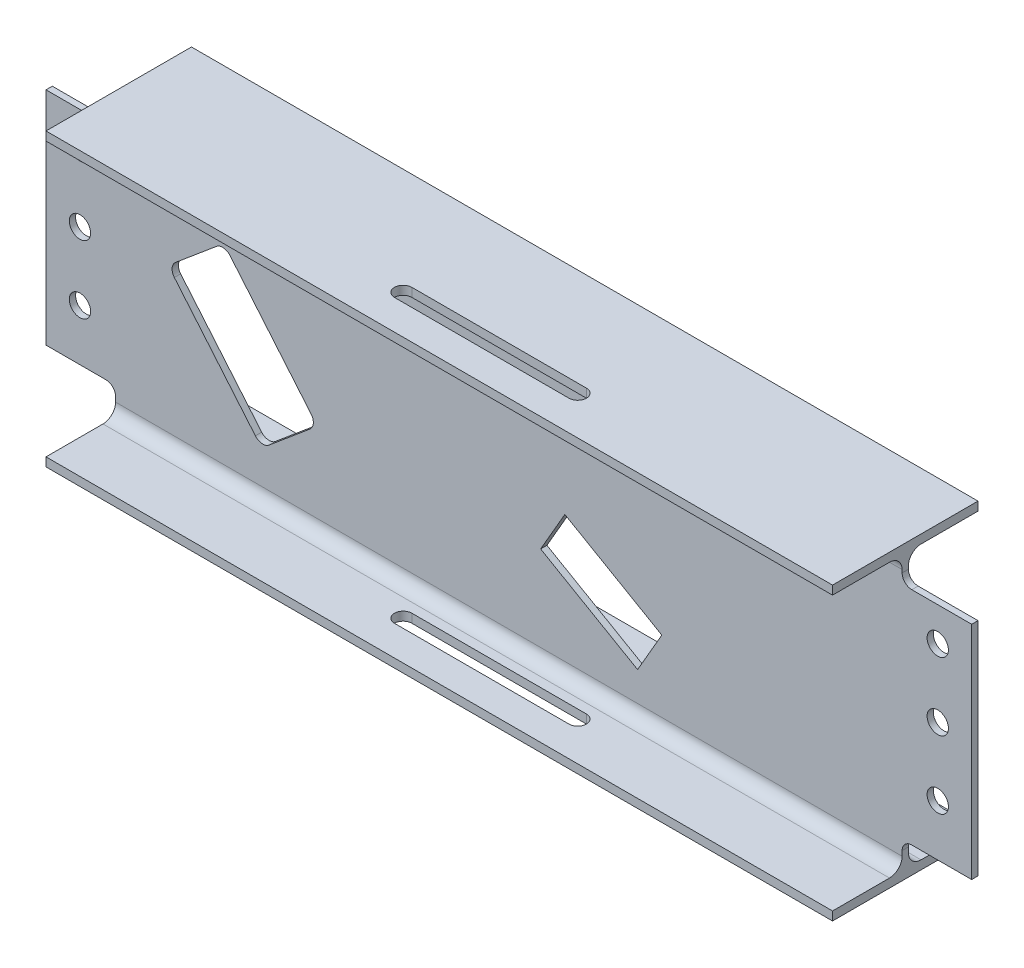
ISO-10303-21;
HEADER;
FILE_DESCRIPTION(('STEP AP214'),'2;1');
FILE_NAME('part.step','',(''),(''),'','','');
FILE_SCHEMA(('AUTOMOTIVE_DESIGN { 1 0 10303 214 1 1 1 1 }'));
ENDSEC;
DATA;
#1=APPLICATION_CONTEXT('core data for automotive mechanical design processes');
#2=APPLICATION_PROTOCOL_DEFINITION('international standard','automotive_design',2000,#1);
#3=PRODUCT_CONTEXT('',#1,'mechanical');
#4=PRODUCT('Part','Part','',(#3));
#5=PRODUCT_RELATED_PRODUCT_CATEGORY('part','',(#4));
#6=PRODUCT_DEFINITION_FORMATION('','',#4);
#7=PRODUCT_DEFINITION_CONTEXT('part definition',#1,'design');
#8=PRODUCT_DEFINITION('design','',#6,#7);
#9=PRODUCT_DEFINITION_SHAPE('','',#8);
#10=(LENGTH_UNIT() NAMED_UNIT(*) SI_UNIT(.MILLI.,.METRE.));
#11=(NAMED_UNIT(*) PLANE_ANGLE_UNIT() SI_UNIT($,.RADIAN.));
#12=(NAMED_UNIT(*) SI_UNIT($,.STERADIAN.) SOLID_ANGLE_UNIT());
#13=UNCERTAINTY_MEASURE_WITH_UNIT(LENGTH_MEASURE(1.E-05),#10,'distance_accuracy_value','');
#14=(GEOMETRIC_REPRESENTATION_CONTEXT(3) GLOBAL_UNCERTAINTY_ASSIGNED_CONTEXT((#13)) GLOBAL_UNIT_ASSIGNED_CONTEXT((#10,
#11,#12)) REPRESENTATION_CONTEXT('',''));
#15=CARTESIAN_POINT('',(0.,0.,0.));
#16=DIRECTION('',(0.,0.,1.));
#17=DIRECTION('',(1.,0.,0.));
#18=AXIS2_PLACEMENT_3D('',#15,#16,#17);
#19=CARTESIAN_POINT('',(1000.,-8.99999999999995,-74.9999999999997));
#20=DIRECTION('',(0.,-1.,0.));
#21=DIRECTION('',(0.,0.,-1.));
#22=AXIS2_PLACEMENT_3D('',#19,#20,#21);
#23=PLANE('',#22);
#24=DIRECTION('',(-1.,0.,0.));
#25=VECTOR('',#24,1.);
#26=CARTESIAN_POINT('',(1000.,-9.00000000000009,-16.2499999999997));
#27=LINE('',#26,#25);
#28=CARTESIAN_POINT('',(905.5,-9.00000000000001,-16.2500000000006));
#29=VERTEX_POINT('',#28);
#30=CARTESIAN_POINT('',(94.4999999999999,-9.00000000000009,-16.2500000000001));
#31=VERTEX_POINT('',#30);
#32=EDGE_CURVE('E758',#29,#31,#27,.T.);
#33=ORIENTED_EDGE('',*,*,#32,.T.);
#34=DIRECTION('',(0.,0.,-1.));
#35=VECTOR('',#34,1.);
#36=CARTESIAN_POINT('',(94.5,-8.99999999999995,-75.0000000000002));
#37=LINE('',#36,#35);
#38=CARTESIAN_POINT('',(94.5,-8.99999999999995,-75.0000000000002));
#39=VERTEX_POINT('',#38);
#40=EDGE_CURVE('E585',#31,#39,#37,.T.);
#41=ORIENTED_EDGE('',*,*,#40,.T.);
#42=DIRECTION('',(-1.,0.,0.));
#43=VECTOR('',#42,1.);
#44=CARTESIAN_POINT('',(1000.,-8.99999999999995,-74.9999999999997));
#45=LINE('',#44,#43);
#46=CARTESIAN_POINT('',(905.5,-8.99999999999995,-75.0000000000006));
#47=VERTEX_POINT('',#46);
#48=EDGE_CURVE('E12',#47,#39,#45,.T.);
#49=ORIENTED_EDGE('',*,*,#48,.F.);
#50=DIRECTION('',(0.,0.,-1.));
#51=VECTOR('',#50,1.);
#52=CARTESIAN_POINT('',(905.5,-8.99999999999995,-75.0000000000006));
#53=LINE('',#52,#51);
#54=EDGE_CURVE('E696',#29,#47,#53,.T.);
#55=ORIENTED_EDGE('',*,*,#54,.F.);
#56=EDGE_LOOP('',(#33,#41,#49,#55));
#57=FACE_BOUND('',#56,.T.);
#58=ADVANCED_FACE('F89',(#57),#23,.T.);
#59=CARTESIAN_POINT('',(1000.,-1.11022302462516E-13,-74.9999999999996));
#60=DIRECTION('',(0.,0.,-1.));
#61=DIRECTION('',(0.,1.,0.));
#62=AXIS2_PLACEMENT_3D('',#59,#60,#61);
#63=PLANE('',#62);
#64=ORIENTED_EDGE('',*,*,#48,.T.);
#65=DIRECTION('',(0.,1.,0.));
#66=VECTOR('',#65,1.);
#67=CARTESIAN_POINT('',(94.5,-1.17529442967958E-13,-75.));
#68=LINE('',#67,#66);
#69=CARTESIAN_POINT('',(94.5,-1.11022304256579E-13,-75.));
#70=VERTEX_POINT('',#69);
#71=EDGE_CURVE('E588',#39,#70,#68,.T.);
#72=ORIENTED_EDGE('',*,*,#71,.T.);
#73=DIRECTION('',(-1.,0.,0.));
#74=VECTOR('',#73,1.);
#75=CARTESIAN_POINT('',(1000.,-1.11022302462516E-13,-74.9999999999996));
#76=LINE('',#75,#74);
#77=CARTESIAN_POINT('',(905.5,-1.11022302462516E-13,-75.0000000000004));
#78=VERTEX_POINT('',#77);
#79=EDGE_CURVE('E97',#78,#70,#76,.T.);
#80=ORIENTED_EDGE('',*,*,#79,.F.);
#81=DIRECTION('',(0.,1.,0.));
#82=VECTOR('',#81,1.);
#83=CARTESIAN_POINT('',(905.5,-1.30543723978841E-13,-75.0000000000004));
#84=LINE('',#83,#82);
#85=EDGE_CURVE('E694',#47,#78,#84,.T.);
#86=ORIENTED_EDGE('',*,*,#85,.F.);
#87=EDGE_LOOP('',(#64,#72,#80,#86));
#88=FACE_BOUND('',#87,.T.);
#89=ADVANCED_FACE('F915',(#88),#63,.T.);
#90=CARTESIAN_POINT('',(1000.,-1.11022302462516E-13,75.0000000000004));
#91=DIRECTION('',(0.,1.,0.));
#92=DIRECTION('',(0.,0.,1.));
#93=AXIS2_PLACEMENT_3D('',#90,#91,#92);
#94=PLANE('',#93);
#95=CARTESIAN_POINT('',(422.75,0.,35.));
#96=DIRECTION('',(0.,1.,0.));
#97=DIRECTION('',(0.,0.,1.));
#98=AXIS2_PLACEMENT_3D('',#95,#96,#97);
#99=CIRCLE('',#98,9.00000000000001);
#100=CARTESIAN_POINT('',(422.75,0.,26.));
#101=VERTEX_POINT('',#100);
#102=CARTESIAN_POINT('',(422.75,-1.11022302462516E-13,44.));
#103=VERTEX_POINT('',#102);
#104=EDGE_CURVE('E105',#101,#103,#99,.T.);
#105=ORIENTED_EDGE('',*,*,#104,.F.);
#106=DIRECTION('',(-1.,0.,0.));
#107=VECTOR('',#106,1.);
#108=CARTESIAN_POINT('',(422.75,0.,26.));
#109=LINE('',#108,#107);
#110=CARTESIAN_POINT('',(602.75,0.,26.));
#111=VERTEX_POINT('',#110);
#112=EDGE_CURVE('E423',#111,#101,#109,.T.);
#113=ORIENTED_EDGE('',*,*,#112,.F.);
#114=CARTESIAN_POINT('',(602.75,0.,35.));
#115=DIRECTION('',(0.,1.,0.));
#116=DIRECTION('',(0.,0.,1.));
#117=AXIS2_PLACEMENT_3D('',#114,#115,#116);
#118=CIRCLE('',#117,9.00000000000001);
#119=CARTESIAN_POINT('',(602.75,0.,44.));
#120=VERTEX_POINT('',#119);
#121=EDGE_CURVE('E426',#120,#111,#118,.T.);
#122=ORIENTED_EDGE('',*,*,#121,.F.);
#123=DIRECTION('',(1.,0.,0.));
#124=VECTOR('',#123,1.);
#125=CARTESIAN_POINT('',(422.75,0.,44.));
#126=LINE('',#125,#124);
#127=EDGE_CURVE('E432',#103,#120,#126,.T.);
#128=ORIENTED_EDGE('',*,*,#127,.F.);
#129=EDGE_LOOP('',(#105,#113,#122,#128));
#130=FACE_BOUND('',#129,.T.);
#131=ORIENTED_EDGE('',*,*,#79,.T.);
#132=DIRECTION('',(0.,0.,1.));
#133=VECTOR('',#132,1.);
#134=CARTESIAN_POINT('',(94.5,-1.11022302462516E-13,75.));
#135=LINE('',#134,#133);
#136=CARTESIAN_POINT('',(94.5,-1.11022302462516E-13,75.));
#137=VERTEX_POINT('',#136);
#138=EDGE_CURVE('E591',#70,#137,#135,.T.);
#139=ORIENTED_EDGE('',*,*,#138,.T.);
#140=DIRECTION('',(-1.,0.,0.));
#141=VECTOR('',#140,1.);
#142=CARTESIAN_POINT('',(1000.,-1.11022302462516E-13,75.0000000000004));
#143=LINE('',#142,#141);
#144=CARTESIAN_POINT('',(905.5,-1.11022301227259E-13,74.9999999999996));
#145=VERTEX_POINT('',#144);
#146=EDGE_CURVE('E797',#145,#137,#143,.T.);
#147=ORIENTED_EDGE('',*,*,#146,.F.);
#148=DIRECTION('',(0.,0.,-1.));
#149=VECTOR('',#148,1.);
#150=CARTESIAN_POINT('',(905.5,-1.11022302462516E-13,-75.0000000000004));
#151=LINE('',#150,#149);
#152=EDGE_CURVE('E691',#145,#78,#151,.T.);
#153=ORIENTED_EDGE('',*,*,#152,.T.);
#154=EDGE_LOOP('',(#131,#139,#147,#153));
#155=FACE_BOUND('',#154,.T.);
#156=ADVANCED_FACE('F912',(#130,#155),#94,.T.);
#157=CARTESIAN_POINT('',(1000.,-1.11022302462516E-13,75.0000000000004));
#158=DIRECTION('',(0.,0.,-1.));
#159=DIRECTION('',(0.,1.,0.));
#160=AXIS2_PLACEMENT_3D('',#157,#158,#159);
#161=PLANE('',#160);
#162=DIRECTION('',(0.,1.,0.));
#163=VECTOR('',#162,1.);
#164=CARTESIAN_POINT('',(94.5,-1.17529442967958E-13,75.));
#165=LINE('',#164,#163);
#166=CARTESIAN_POINT('',(94.5,-8.99999999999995,75.0000000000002));
#167=VERTEX_POINT('',#166);
#168=EDGE_CURVE('E594',#167,#137,#165,.T.);
#169=ORIENTED_EDGE('',*,*,#168,.F.);
#170=DIRECTION('',(-1.,0.,0.));
#171=VECTOR('',#170,1.);
#172=CARTESIAN_POINT('',(1000.,-8.99999999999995,75.0000000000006));
#173=LINE('',#172,#171);
#174=CARTESIAN_POINT('',(905.5,-8.99999999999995,74.9999999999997));
#175=VERTEX_POINT('',#174);
#176=EDGE_CURVE('E794',#175,#167,#173,.T.);
#177=ORIENTED_EDGE('',*,*,#176,.F.);
#178=DIRECTION('',(0.,1.,0.));
#179=VECTOR('',#178,1.);
#180=CARTESIAN_POINT('',(905.5,-1.30543723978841E-13,74.9999999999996));
#181=LINE('',#180,#179);
#182=EDGE_CURVE('E688',#175,#145,#181,.T.);
#183=ORIENTED_EDGE('',*,*,#182,.T.);
#184=ORIENTED_EDGE('',*,*,#146,.T.);
#185=EDGE_LOOP('',(#169,#177,#183,#184));
#186=FACE_BOUND('',#185,.T.);
#187=ADVANCED_FACE('F909',(#186),#161,.F.);
#188=CARTESIAN_POINT('',(1000.,-8.99999999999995,75.0000000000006));
#189=DIRECTION('',(0.,1.,0.));
#190=DIRECTION('',(0.,0.,1.));
#191=AXIS2_PLACEMENT_3D('',#188,#189,#190);
#192=PLANE('',#191);
#193=DIRECTION('',(-1.,0.,0.));
#194=VECTOR('',#193,1.);
#195=CARTESIAN_POINT('',(1000.,-9.,26.));
#196=LINE('',#195,#194);
#197=CARTESIAN_POINT('',(602.75,-9.00000000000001,26.));
#198=VERTEX_POINT('',#197);
#199=CARTESIAN_POINT('',(422.75,-9.00000000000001,26.));
#200=VERTEX_POINT('',#199);
#201=EDGE_CURVE('E456',#198,#200,#196,.T.);
#202=ORIENTED_EDGE('',*,*,#201,.T.);
#203=CARTESIAN_POINT('',(422.75,-9.00000000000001,35.));
#204=DIRECTION('',(0.,1.,0.));
#205=DIRECTION('',(0.,0.,1.));
#206=AXIS2_PLACEMENT_3D('',#203,#204,#205);
#207=CIRCLE('',#206,9.00000000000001);
#208=CARTESIAN_POINT('',(422.75,-9.00000000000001,44.));
#209=VERTEX_POINT('',#208);
#210=EDGE_CURVE('E460',#200,#209,#207,.T.);
#211=ORIENTED_EDGE('',*,*,#210,.T.);
#212=DIRECTION('',(1.,0.,0.));
#213=VECTOR('',#212,1.);
#214=CARTESIAN_POINT('',(1000.,-8.99999999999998,44.));
#215=LINE('',#214,#213);
#216=CARTESIAN_POINT('',(602.75,-8.99999999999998,44.));
#217=VERTEX_POINT('',#216);
#218=EDGE_CURVE('E446',#209,#217,#215,.T.);
#219=ORIENTED_EDGE('',*,*,#218,.T.);
#220=CARTESIAN_POINT('',(602.75,-9.00000000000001,35.));
#221=DIRECTION('',(0.,1.,0.));
#222=DIRECTION('',(0.,0.,1.));
#223=AXIS2_PLACEMENT_3D('',#220,#221,#222);
#224=CIRCLE('',#223,9.00000000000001);
#225=EDGE_CURVE('E451',#217,#198,#224,.T.);
#226=ORIENTED_EDGE('',*,*,#225,.T.);
#227=EDGE_LOOP('',(#202,#211,#219,#226));
#228=FACE_BOUND('',#227,.T.);
#229=DIRECTION('',(0.,0.,1.));
#230=VECTOR('',#229,1.);
#231=CARTESIAN_POINT('',(94.5,-8.99999999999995,75.0000000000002));
#232=LINE('',#231,#230);
#233=CARTESIAN_POINT('',(94.5,-9.00000000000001,16.2500000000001));
#234=VERTEX_POINT('',#233);
#235=EDGE_CURVE('E596',#234,#167,#232,.T.);
#236=ORIENTED_EDGE('',*,*,#235,.F.);
#237=DIRECTION('',(-1.,0.,0.));
#238=VECTOR('',#237,1.);
#239=CARTESIAN_POINT('',(1000.,-9.00000000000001,16.2500000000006));
#240=LINE('',#239,#238);
#241=CARTESIAN_POINT('',(905.5,-9.00000000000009,16.2499999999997));
#242=VERTEX_POINT('',#241);
#243=EDGE_CURVE('E791',#242,#234,#240,.T.);
#244=ORIENTED_EDGE('',*,*,#243,.F.);
#245=DIRECTION('',(0.,0.,1.));
#246=VECTOR('',#245,1.);
#247=CARTESIAN_POINT('',(905.5,-8.99999999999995,74.9999999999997));
#248=LINE('',#247,#246);
#249=EDGE_CURVE('E685',#242,#175,#248,.T.);
#250=ORIENTED_EDGE('',*,*,#249,.T.);
#251=ORIENTED_EDGE('',*,*,#176,.T.);
#252=EDGE_LOOP('',(#236,#244,#250,#251));
#253=FACE_BOUND('',#252,.T.);
#254=ADVANCED_FACE('F903',(#228,#253),#192,.F.);
#255=CARTESIAN_POINT('',(1000.,-22.,16.2500000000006));
#256=DIRECTION('',(-1.,0.,0.));
#257=DIRECTION('',(0.,0.,1.));
#258=AXIS2_PLACEMENT_3D('',#255,#256,#257);
#259=CYLINDRICAL_SURFACE('',#258,12.9999999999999);
#260=CARTESIAN_POINT('',(94.5,-22.,16.2500000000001));
#261=DIRECTION('',(-1.,0.,0.));
#262=DIRECTION('',(0.,-1.,0.));
#263=AXIS2_PLACEMENT_3D('',#260,#261,#262);
#264=CIRCLE('',#263,12.9999999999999);
#265=CARTESIAN_POINT('',(94.5,-22.0000000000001,3.25000000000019));
#266=VERTEX_POINT('',#265);
#267=EDGE_CURVE('E598',#266,#234,#264,.F.);
#268=ORIENTED_EDGE('',*,*,#267,.F.);
#269=DIRECTION('',(-1.,0.,0.));
#270=VECTOR('',#269,1.);
#271=CARTESIAN_POINT('',(1000.,-22.0000000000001,3.25000000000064));
#272=LINE('',#271,#270);
#273=CARTESIAN_POINT('',(905.5,-22.0000000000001,3.24999999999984));
#274=VERTEX_POINT('',#273);
#275=EDGE_CURVE('E788',#274,#266,#272,.T.);
#276=ORIENTED_EDGE('',*,*,#275,.F.);
#277=CARTESIAN_POINT('',(905.5,-22.,16.2499999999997));
#278=DIRECTION('',(1.,0.,0.));
#279=DIRECTION('',(0.,-1.,0.));
#280=AXIS2_PLACEMENT_3D('',#277,#278,#279);
#281=CIRCLE('',#280,12.9999999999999);
#282=EDGE_CURVE('E737',#274,#242,#281,.T.);
#283=ORIENTED_EDGE('',*,*,#282,.T.);
#284=ORIENTED_EDGE('',*,*,#243,.T.);
#285=EDGE_LOOP('',(#268,#276,#283,#284));
#286=FACE_BOUND('',#285,.T.);
#287=ADVANCED_FACE('F827',(#286),#259,.F.);
#288=CARTESIAN_POINT('',(1000.,-22.0000000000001,3.25000000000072));
#289=DIRECTION('',(0.,0.,-1.));
#290=DIRECTION('',(-1.,0.,0.));
#291=AXIS2_PLACEMENT_3D('',#288,#289,#290);
#292=PLANE('',#291);
#293=DIRECTION('',(-0.766044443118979,-0.642787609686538,0.));
#294=VECTOR('',#293,1.);
#295=CARTESIAN_POINT('',(797.238352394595,219.641921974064,3.2500000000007));
#296=LINE('',#295,#294);
#297=CARTESIAN_POINT('',(294.872709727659,-201.892903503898,3.25000000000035));
#298=VERTEX_POINT('',#297);
#299=CARTESIAN_POINT('',(252.740265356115,-237.246222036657,3.25000000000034));
#300=VERTEX_POINT('',#299);
#301=EDGE_CURVE('E521',#298,#300,#296,.T.);
#302=ORIENTED_EDGE('',*,*,#301,.T.);
#303=CARTESIAN_POINT('',(246.31238925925,-229.585777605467,3.25000000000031));
#304=DIRECTION('',(0.,0.,-1.));
#305=DIRECTION('',(-1.,0.,0.));
#306=AXIS2_PLACEMENT_3D('',#303,#304,#305);
#307=CIRCLE('',#306,9.99999999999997);
#308=CARTESIAN_POINT('',(238.65194482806,-236.013653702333,3.25000000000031));
#309=VERTEX_POINT('',#308);
#310=EDGE_CURVE('E524',#300,#309,#307,.T.);
#311=ORIENTED_EDGE('',*,*,#310,.T.);
#312=DIRECTION('',(-0.642787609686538,0.766044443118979,0.));
#313=VECTOR('',#312,1.);
#314=CARTESIAN_POINT('',(447.841468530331,-485.316020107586,3.25000000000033));
#315=LINE('',#314,#313);
#316=CARTESIAN_POINT('',(155.08955556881,-136.427876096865,3.25000000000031));
#317=VERTEX_POINT('',#316);
#318=EDGE_CURVE('E489',#309,#317,#315,.T.);
#319=ORIENTED_EDGE('',*,*,#318,.T.);
#320=CARTESIAN_POINT('',(162.75,-130.,3.25000000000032));
#321=DIRECTION('',(0.,0.,-1.));
#322=DIRECTION('',(-1.,0.,0.));
#323=AXIS2_PLACEMENT_3D('',#320,#321,#322);
#324=CIRCLE('',#323,9.99999999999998);
#325=CARTESIAN_POINT('',(156.322123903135,-122.33955556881,3.25000000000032));
#326=VERTEX_POINT('',#325);
#327=EDGE_CURVE('E506',#317,#326,#324,.T.);
#328=ORIENTED_EDGE('',*,*,#327,.T.);
#329=DIRECTION('',(0.76604444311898,0.642787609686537,0.));
#330=VECTOR('',#329,1.);
#331=CARTESIAN_POINT('',(700.820210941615,334.54858844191,3.25000000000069));
#332=LINE('',#331,#330);
#333=CARTESIAN_POINT('',(198.454568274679,-86.9862370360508,3.25000000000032));
#334=VERTEX_POINT('',#333);
#335=EDGE_CURVE('E509',#326,#334,#332,.T.);
#336=ORIENTED_EDGE('',*,*,#335,.T.);
#337=CARTESIAN_POINT('',(204.882444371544,-94.6466814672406,3.25000000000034));
#338=DIRECTION('',(0.,0.,-1.));
#339=DIRECTION('',(-1.,0.,0.));
#340=AXIS2_PLACEMENT_3D('',#337,#338,#339);
#341=CIRCLE('',#340,10.);
#342=CARTESIAN_POINT('',(212.542888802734,-88.2188053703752,3.25000000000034));
#343=VERTEX_POINT('',#342);
#344=EDGE_CURVE('E512',#334,#343,#341,.T.);
#345=ORIENTED_EDGE('',*,*,#344,.T.);
#346=DIRECTION('',(0.642787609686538,-0.766044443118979,0.));
#347=VECTOR('',#346,1.);
#348=CARTESIAN_POINT('',(505.294801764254,-437.106949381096,3.25000000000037));
#349=LINE('',#348,#347);
#350=CARTESIAN_POINT('',(296.105278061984,-187.804582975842,3.25000000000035));
#351=VERTEX_POINT('',#350);
#352=EDGE_CURVE('E515',#343,#351,#349,.T.);
#353=ORIENTED_EDGE('',*,*,#352,.T.);
#354=CARTESIAN_POINT('',(288.444833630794,-194.232459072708,3.25000000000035));
#355=DIRECTION('',(0.,0.,-1.));
#356=DIRECTION('',(-1.,0.,0.));
#357=AXIS2_PLACEMENT_3D('',#354,#355,#356);
#358=CIRCLE('',#357,10.);
#359=EDGE_CURVE('E518',#351,#298,#358,.T.);
#360=ORIENTED_EDGE('',*,*,#359,.T.);
#361=EDGE_LOOP('',(#302,#311,#319,#328,#336,#345,#353,#360));
#362=FACE_BOUND('',#361,.T.);
#363=DIRECTION('',(0.866025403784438,-0.500000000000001,0.));
#364=VECTOR('',#363,1.);
#365=CARTESIAN_POINT('',(835.441366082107,-307.023914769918,3.25000000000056));
#366=LINE('',#365,#364);
#367=CARTESIAN_POINT('',(557.75,-146.698729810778,3.25000000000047));
#368=VERTEX_POINT('',#367);
#369=CARTESIAN_POINT('',(657.75,-204.433756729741,3.2500000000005));
#370=VERTEX_POINT('',#369);
#371=EDGE_CURVE('E553',#368,#370,#366,.T.);
#372=ORIENTED_EDGE('',*,*,#371,.T.);
#373=DIRECTION('',(-0.499999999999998,-0.86602540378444,0.));
#374=VECTOR('',#373,1.);
#375=CARTESIAN_POINT('',(822.308633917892,80.5901580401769,3.25000000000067));
#376=LINE('',#375,#374);
#377=CARTESIAN_POINT('',(632.75,-247.735026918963,3.25000000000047));
#378=VERTEX_POINT('',#377);
#379=EDGE_CURVE('E556',#370,#378,#376,.T.);
#380=ORIENTED_EDGE('',*,*,#379,.T.);
#381=DIRECTION('',(-0.866025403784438,0.500000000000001,0.));
#382=VECTOR('',#381,1.);
#383=CARTESIAN_POINT('',(810.441366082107,-350.32518495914,3.25000000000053));
#384=LINE('',#383,#382);
#385=CARTESIAN_POINT('',(532.75,-190.,3.25000000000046));
#386=VERTEX_POINT('',#385);
#387=EDGE_CURVE('E541',#378,#386,#384,.T.);
#388=ORIENTED_EDGE('',*,*,#387,.T.);
#389=DIRECTION('',(0.5,0.866025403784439,0.));
#390=VECTOR('',#389,1.);
#391=CARTESIAN_POINT('',(722.308633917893,138.32518495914,3.25000000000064));
#392=LINE('',#391,#390);
#393=EDGE_CURVE('E550',#386,#368,#392,.T.);
#394=ORIENTED_EDGE('',*,*,#393,.T.);
#395=EDGE_LOOP('',(#372,#380,#388,#394));
#396=FACE_BOUND('',#395,.T.);
#397=CARTESIAN_POINT('',(57.7500000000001,-140.,3.25000000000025));
#398=DIRECTION('',(0.,0.,-1.));
#399=DIRECTION('',(-1.,0.,0.));
#400=AXIS2_PLACEMENT_3D('',#397,#398,#399);
#401=CIRCLE('',#400,11.);
#402=CARTESIAN_POINT('',(46.7500000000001,-140.,3.25000000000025));
#403=VERTEX_POINT('',#402);
#404=EDGE_CURVE('E563',#403,#403,#401,.F.);
#405=ORIENTED_EDGE('',*,*,#404,.F.);
#406=EDGE_LOOP('',(#405));
#407=FACE_BOUND('',#406,.T.);
#408=CARTESIAN_POINT('',(57.7500000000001,-70.,3.25000000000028));
#409=DIRECTION('',(0.,0.,-1.));
#410=DIRECTION('',(-1.,0.,0.));
#411=AXIS2_PLACEMENT_3D('',#408,#409,#410);
#412=CIRCLE('',#411,11.);
#413=CARTESIAN_POINT('',(46.7500000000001,-70.,3.25000000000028));
#414=VERTEX_POINT('',#413);
#415=EDGE_CURVE('E560',#414,#414,#412,.F.);
#416=ORIENTED_EDGE('',*,*,#415,.F.);
#417=EDGE_LOOP('',(#416));
#418=FACE_BOUND('',#417,.T.);
#419=CARTESIAN_POINT('',(57.7500000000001,-210.,3.25000000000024));
#420=DIRECTION('',(0.,0.,-1.));
#421=DIRECTION('',(-1.,0.,0.));
#422=AXIS2_PLACEMENT_3D('',#419,#420,#421);
#423=CIRCLE('',#422,11.0000000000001);
#424=CARTESIAN_POINT('',(46.75,-210.,3.25000000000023));
#425=VERTEX_POINT('',#424);
#426=EDGE_CURVE('E567',#425,#425,#423,.F.);
#427=ORIENTED_EDGE('',*,*,#426,.F.);
#428=EDGE_LOOP('',(#427));
#429=FACE_BOUND('',#428,.T.);
#430=CARTESIAN_POINT('',(942.25,-210.,3.25000000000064));
#431=DIRECTION('',(0.,0.,-1.));
#432=DIRECTION('',(-1.,0.,0.));
#433=AXIS2_PLACEMENT_3D('',#430,#431,#432);
#434=CIRCLE('',#433,11.);
#435=CARTESIAN_POINT('',(931.25,-210.,3.25000000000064));
#436=VERTEX_POINT('',#435);
#437=EDGE_CURVE('E663',#436,#436,#434,.F.);
#438=ORIENTED_EDGE('',*,*,#437,.F.);
#439=EDGE_LOOP('',(#438));
#440=FACE_BOUND('',#439,.T.);
#441=CARTESIAN_POINT('',(942.25,-140.,3.25000000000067));
#442=DIRECTION('',(0.,0.,-1.));
#443=DIRECTION('',(-1.,0.,0.));
#444=AXIS2_PLACEMENT_3D('',#441,#442,#443);
#445=CIRCLE('',#444,11.);
#446=CARTESIAN_POINT('',(931.25,-140.,3.25000000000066));
#447=VERTEX_POINT('',#446);
#448=EDGE_CURVE('E659',#447,#447,#445,.F.);
#449=ORIENTED_EDGE('',*,*,#448,.F.);
#450=EDGE_LOOP('',(#449));
#451=FACE_BOUND('',#450,.T.);
#452=CARTESIAN_POINT('',(942.25,-70.,3.25000000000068));
#453=DIRECTION('',(0.,0.,-1.));
#454=DIRECTION('',(-1.,0.,0.));
#455=AXIS2_PLACEMENT_3D('',#452,#453,#454);
#456=CIRCLE('',#455,11.);
#457=CARTESIAN_POINT('',(931.25,-70.,3.25000000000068));
#458=VERTEX_POINT('',#457);
#459=EDGE_CURVE('E667',#458,#458,#456,.F.);
#460=ORIENTED_EDGE('',*,*,#459,.F.);
#461=EDGE_LOOP('',(#460));
#462=FACE_BOUND('',#461,.T.);
#463=DIRECTION('',(0.,1.,0.));
#464=VECTOR('',#463,1.);
#465=CARTESIAN_POINT('',(94.5,-22.0000000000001,3.25000000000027));
#466=LINE('',#465,#464);
#467=CARTESIAN_POINT('',(94.5,-278.,3.25000000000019));
#468=VERTEX_POINT('',#467);
#469=CARTESIAN_POINT('',(94.5,-273.,3.2500000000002));
#470=VERTEX_POINT('',#469);
#471=EDGE_CURVE('E619',#468,#470,#466,.T.);
#472=ORIENTED_EDGE('',*,*,#471,.F.);
#473=DIRECTION('',(-1.,0.,0.));
#474=VECTOR('',#473,1.);
#475=CARTESIAN_POINT('',(1000.,-278.,3.25000000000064));
#476=LINE('',#475,#474);
#477=CARTESIAN_POINT('',(905.5,-278.,3.24999999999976));
#478=VERTEX_POINT('',#477);
#479=EDGE_CURVE('E785',#478,#468,#476,.T.);
#480=ORIENTED_EDGE('',*,*,#479,.F.);
#481=DIRECTION('',(0.,1.,0.));
#482=VECTOR('',#481,1.);
#483=CARTESIAN_POINT('',(905.5,-22.0000000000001,3.24999999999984));
#484=LINE('',#483,#482);
#485=CARTESIAN_POINT('',(905.5,-273.,3.24999999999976));
#486=VERTEX_POINT('',#485);
#487=EDGE_CURVE('E740',#478,#486,#484,.T.);
#488=ORIENTED_EDGE('',*,*,#487,.T.);
#489=CARTESIAN_POINT('',(915.5,-273.,3.24999999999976));
#490=DIRECTION('',(0.,0.,1.));
#491=DIRECTION('',(0.,1.,0.));
#492=AXIS2_PLACEMENT_3D('',#489,#490,#491);
#493=CIRCLE('',#492,9.99999999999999);
#494=CARTESIAN_POINT('',(915.5,-263.,3.24999999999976));
#495=VERTEX_POINT('',#494);
#496=EDGE_CURVE('E743',#486,#495,#493,.F.);
#497=ORIENTED_EDGE('',*,*,#496,.T.);
#498=DIRECTION('',(1.,0.,0.));
#499=VECTOR('',#498,1.);
#500=CARTESIAN_POINT('',(800.,-263.,3.24999999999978));
#501=LINE('',#500,#499);
#502=CARTESIAN_POINT('',(977.25,-263.,3.24999999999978));
#503=VERTEX_POINT('',#502);
#504=EDGE_CURVE('E746',#495,#503,#501,.T.);
#505=ORIENTED_EDGE('',*,*,#504,.T.);
#506=DIRECTION('',(0.,1.,0.));
#507=VECTOR('',#506,1.);
#508=CARTESIAN_POINT('',(977.25,-22.0000000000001,3.24999999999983));
#509=LINE('',#508,#507);
#510=CARTESIAN_POINT('',(977.25,-35.,3.24999999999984));
#511=VERTEX_POINT('',#510);
#512=EDGE_CURVE('E749',#503,#511,#509,.T.);
#513=ORIENTED_EDGE('',*,*,#512,.T.);
#514=DIRECTION('',(-1.,0.,0.));
#515=VECTOR('',#514,1.);
#516=CARTESIAN_POINT('',(800.,-35.,3.24999999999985));
#517=LINE('',#516,#515);
#518=CARTESIAN_POINT('',(915.5,-35.,3.24999999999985));
#519=VERTEX_POINT('',#518);
#520=EDGE_CURVE('E752',#511,#519,#517,.T.);
#521=ORIENTED_EDGE('',*,*,#520,.T.);
#522=CARTESIAN_POINT('',(915.5,-24.9999999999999,3.24999999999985));
#523=DIRECTION('',(0.,0.,1.));
#524=DIRECTION('',(0.,1.,0.));
#525=AXIS2_PLACEMENT_3D('',#522,#523,#524);
#526=CIRCLE('',#525,10.);
#527=CARTESIAN_POINT('',(905.5,-24.9999999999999,3.24999999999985));
#528=VERTEX_POINT('',#527);
#529=EDGE_CURVE('E755',#519,#528,#526,.F.);
#530=ORIENTED_EDGE('',*,*,#529,.T.);
#531=DIRECTION('',(0.,1.,0.));
#532=VECTOR('',#531,1.);
#533=CARTESIAN_POINT('',(905.5,-22.0000000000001,3.24999999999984));
#534=LINE('',#533,#532);
#535=EDGE_CURVE('E682',#528,#274,#534,.T.);
#536=ORIENTED_EDGE('',*,*,#535,.T.);
#537=ORIENTED_EDGE('',*,*,#275,.T.);
#538=DIRECTION('',(0.,1.,0.));
#539=VECTOR('',#538,1.);
#540=CARTESIAN_POINT('',(94.5,-22.0000000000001,3.25000000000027));
#541=LINE('',#540,#539);
#542=CARTESIAN_POINT('',(94.5,-24.9999999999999,3.25000000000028));
#543=VERTEX_POINT('',#542);
#544=EDGE_CURVE('E600',#543,#266,#541,.T.);
#545=ORIENTED_EDGE('',*,*,#544,.F.);
#546=CARTESIAN_POINT('',(84.5,-24.9999999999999,3.25000000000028));
#547=DIRECTION('',(0.,0.,-1.));
#548=DIRECTION('',(0.,1.,0.));
#549=AXIS2_PLACEMENT_3D('',#546,#547,#548);
#550=CIRCLE('',#549,9.99999999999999);
#551=CARTESIAN_POINT('',(84.5,-34.9999999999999,3.25000000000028));
#552=VERTEX_POINT('',#551);
#553=EDGE_CURVE('E622',#552,#543,#550,.F.);
#554=ORIENTED_EDGE('',*,*,#553,.F.);
#555=DIRECTION('',(1.,0.,0.));
#556=VECTOR('',#555,1.);
#557=CARTESIAN_POINT('',(200.,-34.9999999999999,3.25000000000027));
#558=LINE('',#557,#556);
#559=CARTESIAN_POINT('',(22.7500000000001,-35.,3.25000000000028));
#560=VERTEX_POINT('',#559);
#561=EDGE_CURVE('E625',#560,#552,#558,.T.);
#562=ORIENTED_EDGE('',*,*,#561,.F.);
#563=DIRECTION('',(0.,1.,0.));
#564=VECTOR('',#563,1.);
#565=CARTESIAN_POINT('',(22.7500000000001,-22.0000000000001,3.25000000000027));
#566=LINE('',#565,#564);
#567=CARTESIAN_POINT('',(22.7500000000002,-263.,3.25000000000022));
#568=VERTEX_POINT('',#567);
#569=EDGE_CURVE('E628',#568,#560,#566,.T.);
#570=ORIENTED_EDGE('',*,*,#569,.F.);
#571=DIRECTION('',(-1.,0.,0.));
#572=VECTOR('',#571,1.);
#573=CARTESIAN_POINT('',(200.,-263.,3.2500000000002));
#574=LINE('',#573,#572);
#575=CARTESIAN_POINT('',(84.5,-263.,3.2500000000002));
#576=VERTEX_POINT('',#575);
#577=EDGE_CURVE('E631',#576,#568,#574,.T.);
#578=ORIENTED_EDGE('',*,*,#577,.F.);
#579=CARTESIAN_POINT('',(84.5,-273.,3.2500000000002));
#580=DIRECTION('',(0.,0.,-1.));
#581=DIRECTION('',(0.,1.,0.));
#582=AXIS2_PLACEMENT_3D('',#579,#580,#581);
#583=CIRCLE('',#582,10.);
#584=EDGE_CURVE('E634',#470,#576,#583,.F.);
#585=ORIENTED_EDGE('',*,*,#584,.F.);
#586=EDGE_LOOP('',(#472,#480,#488,#497,#505,#513,#521,#530,#536,#537,#545,#554,#562,#570,#578,#585));
#587=FACE_BOUND('',#586,.T.);
#588=ADVANCED_FACE('F823',(#362,#396,#407,#418,#429,#440,#451,#462,#587),#292,.F.);
#589=CARTESIAN_POINT('',(1000.,-278.,16.2500000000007));
#590=DIRECTION('',(-1.,0.,0.));
#591=DIRECTION('',(0.,0.,1.));
#592=AXIS2_PLACEMENT_3D('',#589,#590,#591);
#593=CYLINDRICAL_SURFACE('',#592,13.);
#594=ORIENTED_EDGE('',*,*,#479,.T.);
#595=CARTESIAN_POINT('',(94.5,-278.,16.2500000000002));
#596=DIRECTION('',(-1.,0.,0.));
#597=DIRECTION('',(0.,-1.,0.));
#598=AXIS2_PLACEMENT_3D('',#595,#596,#597);
#599=CIRCLE('',#598,13.);
#600=CARTESIAN_POINT('',(94.5,-291.,16.2500000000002));
#601=VERTEX_POINT('',#600);
#602=EDGE_CURVE('E616',#468,#601,#599,.T.);
#603=ORIENTED_EDGE('',*,*,#602,.T.);
#604=DIRECTION('',(-1.,0.,0.));
#605=VECTOR('',#604,1.);
#606=CARTESIAN_POINT('',(1000.,-291.,16.2500000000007));
#607=LINE('',#606,#605);
#608=CARTESIAN_POINT('',(905.5,-291.,16.2499999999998));
#609=VERTEX_POINT('',#608);
#610=EDGE_CURVE('E782',#609,#601,#607,.T.);
#611=ORIENTED_EDGE('',*,*,#610,.F.);
#612=CARTESIAN_POINT('',(905.5,-278.,16.2499999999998));
#613=DIRECTION('',(1.,0.,0.));
#614=DIRECTION('',(0.,-1.,0.));
#615=AXIS2_PLACEMENT_3D('',#612,#613,#614);
#616=CIRCLE('',#615,13.);
#617=EDGE_CURVE('E702',#478,#609,#616,.F.);
#618=ORIENTED_EDGE('',*,*,#617,.F.);
#619=EDGE_LOOP('',(#594,#603,#611,#618));
#620=FACE_BOUND('',#619,.T.);
#621=ADVANCED_FACE('F826',(#620),#593,.F.);
#622=CARTESIAN_POINT('',(1000.,-291.,75.0000000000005));
#623=DIRECTION('',(0.,1.,0.));
#624=DIRECTION('',(0.,0.,1.));
#625=AXIS2_PLACEMENT_3D('',#622,#623,#624);
#626=PLANE('',#625);
#627=CARTESIAN_POINT('',(422.75,-291.,35.));
#628=DIRECTION('',(0.,1.,0.));
#629=DIRECTION('',(0.,0.,1.));
#630=AXIS2_PLACEMENT_3D('',#627,#628,#629);
#631=CIRCLE('',#630,9.00000000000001);
#632=CARTESIAN_POINT('',(422.75,-291.,26.));
#633=VERTEX_POINT('',#632);
#634=CARTESIAN_POINT('',(422.75,-291.,44.));
#635=VERTEX_POINT('',#634);
#636=EDGE_CURVE('E404',#633,#635,#631,.T.);
#637=ORIENTED_EDGE('',*,*,#636,.F.);
#638=DIRECTION('',(-1.,0.,0.));
#639=VECTOR('',#638,1.);
#640=CARTESIAN_POINT('',(1000.,-291.,26.));
#641=LINE('',#640,#639);
#642=CARTESIAN_POINT('',(602.75,-291.,26.));
#643=VERTEX_POINT('',#642);
#644=EDGE_CURVE('E454',#643,#633,#641,.T.);
#645=ORIENTED_EDGE('',*,*,#644,.F.);
#646=CARTESIAN_POINT('',(602.75,-291.,35.));
#647=DIRECTION('',(0.,1.,0.));
#648=DIRECTION('',(0.,0.,1.));
#649=AXIS2_PLACEMENT_3D('',#646,#647,#648);
#650=CIRCLE('',#649,9.00000000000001);
#651=CARTESIAN_POINT('',(602.75,-291.,44.));
#652=VERTEX_POINT('',#651);
#653=EDGE_CURVE('E449',#652,#643,#650,.T.);
#654=ORIENTED_EDGE('',*,*,#653,.F.);
#655=DIRECTION('',(1.,0.,0.));
#656=VECTOR('',#655,1.);
#657=CARTESIAN_POINT('',(1000.,-291.,44.));
#658=LINE('',#657,#656);
#659=EDGE_CURVE('E438',#635,#652,#658,.T.);
#660=ORIENTED_EDGE('',*,*,#659,.F.);
#661=EDGE_LOOP('',(#637,#645,#654,#660));
#662=FACE_BOUND('',#661,.T.);
#663=ORIENTED_EDGE('',*,*,#610,.T.);
#664=DIRECTION('',(0.,0.,1.));
#665=VECTOR('',#664,1.);
#666=CARTESIAN_POINT('',(94.5,-291.,75.0000000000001));
#667=LINE('',#666,#665);
#668=CARTESIAN_POINT('',(94.5,-291.,75.0000000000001));
#669=VERTEX_POINT('',#668);
#670=EDGE_CURVE('E613',#601,#669,#667,.T.);
#671=ORIENTED_EDGE('',*,*,#670,.T.);
#672=DIRECTION('',(-1.,0.,0.));
#673=VECTOR('',#672,1.);
#674=CARTESIAN_POINT('',(1000.,-291.,75.0000000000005));
#675=LINE('',#674,#673);
#676=CARTESIAN_POINT('',(905.5,-291.,74.9999999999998));
#677=VERTEX_POINT('',#676);
#678=EDGE_CURVE('E779',#677,#669,#675,.T.);
#679=ORIENTED_EDGE('',*,*,#678,.F.);
#680=DIRECTION('',(0.,0.,1.));
#681=VECTOR('',#680,1.);
#682=CARTESIAN_POINT('',(905.5,-291.,74.9999999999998));
#683=LINE('',#682,#681);
#684=EDGE_CURVE('E704',#609,#677,#683,.T.);
#685=ORIENTED_EDGE('',*,*,#684,.F.);
#686=EDGE_LOOP('',(#663,#671,#679,#685));
#687=FACE_BOUND('',#686,.T.);
#688=ADVANCED_FACE('F852',(#662,#687),#626,.T.);
#689=CARTESIAN_POINT('',(1000.,-300.,75.0000000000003));
#690=DIRECTION('',(0.,0.,1.));
#691=DIRECTION('',(0.,-1.,0.));
#692=AXIS2_PLACEMENT_3D('',#689,#690,#691);
#693=PLANE('',#692);
#694=ORIENTED_EDGE('',*,*,#678,.T.);
#695=DIRECTION('',(0.,-1.,0.));
#696=VECTOR('',#695,1.);
#697=CARTESIAN_POINT('',(94.5,-300.,74.9999999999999));
#698=LINE('',#697,#696);
#699=CARTESIAN_POINT('',(94.5,-300.,74.9999999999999));
#700=VERTEX_POINT('',#699);
#701=EDGE_CURVE('E610',#669,#700,#698,.T.);
#702=ORIENTED_EDGE('',*,*,#701,.T.);
#703=DIRECTION('',(-1.,0.,0.));
#704=VECTOR('',#703,1.);
#705=CARTESIAN_POINT('',(1000.,-300.,75.0000000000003));
#706=LINE('',#705,#704);
#707=CARTESIAN_POINT('',(905.5,-300.,74.9999999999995));
#708=VERTEX_POINT('',#707);
#709=EDGE_CURVE('E776',#708,#700,#706,.T.);
#710=ORIENTED_EDGE('',*,*,#709,.F.);
#711=DIRECTION('',(0.,-1.,0.));
#712=VECTOR('',#711,1.);
#713=CARTESIAN_POINT('',(905.5,-300.,74.9999999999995));
#714=LINE('',#713,#712);
#715=EDGE_CURVE('E706',#677,#708,#714,.T.);
#716=ORIENTED_EDGE('',*,*,#715,.F.);
#717=EDGE_LOOP('',(#694,#702,#710,#716));
#718=FACE_BOUND('',#717,.T.);
#719=ADVANCED_FACE('F854',(#718),#693,.T.);
#720=CARTESIAN_POINT('',(1000.,-300.,75.0000000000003));
#721=DIRECTION('',(0.,1.,0.));
#722=DIRECTION('',(0.,0.,1.));
#723=AXIS2_PLACEMENT_3D('',#720,#721,#722);
#724=PLANE('',#723);
#725=DIRECTION('',(-1.,0.,0.));
#726=VECTOR('',#725,1.);
#727=CARTESIAN_POINT('',(422.75,-300.,26.));
#728=LINE('',#727,#726);
#729=CARTESIAN_POINT('',(602.75,-300.,26.));
#730=VERTEX_POINT('',#729);
#731=CARTESIAN_POINT('',(422.75,-300.,26.));
#732=VERTEX_POINT('',#731);
#733=EDGE_CURVE('E422',#730,#732,#728,.T.);
#734=ORIENTED_EDGE('',*,*,#733,.T.);
#735=CARTESIAN_POINT('',(422.75,-300.,35.));
#736=DIRECTION('',(0.,1.,0.));
#737=DIRECTION('',(0.,0.,1.));
#738=AXIS2_PLACEMENT_3D('',#735,#736,#737);
#739=CIRCLE('',#738,9.00000000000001);
#740=CARTESIAN_POINT('',(422.75,-300.,44.));
#741=VERTEX_POINT('',#740);
#742=EDGE_CURVE('E401',#732,#741,#739,.T.);
#743=ORIENTED_EDGE('',*,*,#742,.T.);
#744=DIRECTION('',(1.,0.,0.));
#745=VECTOR('',#744,1.);
#746=CARTESIAN_POINT('',(422.75,-300.,44.));
#747=LINE('',#746,#745);
#748=CARTESIAN_POINT('',(602.75,-300.,44.));
#749=VERTEX_POINT('',#748);
#750=EDGE_CURVE('E411',#741,#749,#747,.T.);
#751=ORIENTED_EDGE('',*,*,#750,.T.);
#752=CARTESIAN_POINT('',(602.75,-300.,35.));
#753=DIRECTION('',(0.,1.,0.));
#754=DIRECTION('',(0.,0.,1.));
#755=AXIS2_PLACEMENT_3D('',#752,#753,#754);
#756=CIRCLE('',#755,9.00000000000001);
#757=EDGE_CURVE('E417',#749,#730,#756,.T.);
#758=ORIENTED_EDGE('',*,*,#757,.T.);
#759=EDGE_LOOP('',(#734,#743,#751,#758));
#760=FACE_BOUND('',#759,.T.);
#761=DIRECTION('',(0.,0.,1.));
#762=VECTOR('',#761,1.);
#763=CARTESIAN_POINT('',(94.5,-300.,74.9999999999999));
#764=LINE('',#763,#762);
#765=CARTESIAN_POINT('',(94.5,-300.,-74.9999999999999));
#766=VERTEX_POINT('',#765);
#767=EDGE_CURVE('E608',#766,#700,#764,.T.);
#768=ORIENTED_EDGE('',*,*,#767,.F.);
#769=DIRECTION('',(-1.,0.,0.));
#770=VECTOR('',#769,1.);
#771=CARTESIAN_POINT('',(1000.,-300.,-74.9999999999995));
#772=LINE('',#771,#770);
#773=CARTESIAN_POINT('',(905.5,-300.,-75.0000000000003));
#774=VERTEX_POINT('',#773);
#775=EDGE_CURVE('E773',#774,#766,#772,.T.);
#776=ORIENTED_EDGE('',*,*,#775,.F.);
#777=DIRECTION('',(0.,0.,-1.));
#778=VECTOR('',#777,1.);
#779=CARTESIAN_POINT('',(905.5,-300.,-75.0000000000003));
#780=LINE('',#779,#778);
#781=EDGE_CURVE('E708',#708,#774,#780,.T.);
#782=ORIENTED_EDGE('',*,*,#781,.F.);
#783=ORIENTED_EDGE('',*,*,#709,.T.);
#784=EDGE_LOOP('',(#768,#776,#782,#783));
#785=FACE_BOUND('',#784,.T.);
#786=ADVANCED_FACE('F419',(#760,#785),#724,.F.);
#787=CARTESIAN_POINT('',(1000.,-300.,-74.9999999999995));
#788=DIRECTION('',(0.,0.,1.));
#789=DIRECTION('',(0.,-1.,0.));
#790=AXIS2_PLACEMENT_3D('',#787,#788,#789);
#791=PLANE('',#790);
#792=DIRECTION('',(0.,-1.,0.));
#793=VECTOR('',#792,1.);
#794=CARTESIAN_POINT('',(94.5,-300.,-74.9999999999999));
#795=LINE('',#794,#793);
#796=CARTESIAN_POINT('',(94.5,-291.,-75.0000000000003));
#797=VERTEX_POINT('',#796);
#798=EDGE_CURVE('E606',#797,#766,#795,.T.);
#799=ORIENTED_EDGE('',*,*,#798,.F.);
#800=DIRECTION('',(-1.,0.,0.));
#801=VECTOR('',#800,1.);
#802=CARTESIAN_POINT('',(1000.,-291.,-74.9999999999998));
#803=LINE('',#802,#801);
#804=CARTESIAN_POINT('',(905.5,-291.,-75.0000000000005));
#805=VERTEX_POINT('',#804);
#806=EDGE_CURVE('E770',#805,#797,#803,.T.);
#807=ORIENTED_EDGE('',*,*,#806,.F.);
#808=DIRECTION('',(0.,-1.,0.));
#809=VECTOR('',#808,1.);
#810=CARTESIAN_POINT('',(905.5,-300.,-75.0000000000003));
#811=LINE('',#810,#809);
#812=EDGE_CURVE('E710',#805,#774,#811,.T.);
#813=ORIENTED_EDGE('',*,*,#812,.T.);
#814=ORIENTED_EDGE('',*,*,#775,.T.);
#815=EDGE_LOOP('',(#799,#807,#813,#814));
#816=FACE_BOUND('',#815,.T.);
#817=ADVANCED_FACE('F861',(#816),#791,.F.);
#818=CARTESIAN_POINT('',(1000.,-291.,-74.9999999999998));
#819=DIRECTION('',(0.,-1.,0.));
#820=DIRECTION('',(0.,0.,-1.));
#821=AXIS2_PLACEMENT_3D('',#818,#819,#820);
#822=PLANE('',#821);
#823=DIRECTION('',(0.,0.,-1.));
#824=VECTOR('',#823,1.);
#825=CARTESIAN_POINT('',(94.5,-291.,-75.0000000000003));
#826=LINE('',#825,#824);
#827=CARTESIAN_POINT('',(94.5,-291.,-16.2500000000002));
#828=VERTEX_POINT('',#827);
#829=EDGE_CURVE('E604',#828,#797,#826,.T.);
#830=ORIENTED_EDGE('',*,*,#829,.F.);
#831=DIRECTION('',(-1.,0.,0.));
#832=VECTOR('',#831,1.);
#833=CARTESIAN_POINT('',(1000.,-291.,-16.2499999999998));
#834=LINE('',#833,#832);
#835=CARTESIAN_POINT('',(905.5,-291.,-16.2500000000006));
#836=VERTEX_POINT('',#835);
#837=EDGE_CURVE('E767',#836,#828,#834,.T.);
#838=ORIENTED_EDGE('',*,*,#837,.F.);
#839=DIRECTION('',(0.,0.,-1.));
#840=VECTOR('',#839,1.);
#841=CARTESIAN_POINT('',(905.5,-291.,-75.0000000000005));
#842=LINE('',#841,#840);
#843=EDGE_CURVE('E713',#836,#805,#842,.T.);
#844=ORIENTED_EDGE('',*,*,#843,.T.);
#845=ORIENTED_EDGE('',*,*,#806,.T.);
#846=EDGE_LOOP('',(#830,#838,#844,#845));
#847=FACE_BOUND('',#846,.T.);
#848=ADVANCED_FACE('F866',(#847),#822,.F.);
#849=CARTESIAN_POINT('',(1000.,-278.,-16.2499999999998));
#850=DIRECTION('',(-1.,0.,0.));
#851=DIRECTION('',(0.,0.,1.));
#852=AXIS2_PLACEMENT_3D('',#849,#850,#851);
#853=CYLINDRICAL_SURFACE('',#852,13.);
#854=CARTESIAN_POINT('',(94.5,-278.,-16.2500000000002));
#855=DIRECTION('',(-1.,0.,0.));
#856=DIRECTION('',(0.,-1.,0.));
#857=AXIS2_PLACEMENT_3D('',#854,#855,#856);
#858=CIRCLE('',#857,13.);
#859=CARTESIAN_POINT('',(94.5,-278.,-3.2500000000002));
#860=VERTEX_POINT('',#859);
#861=EDGE_CURVE('E602',#860,#828,#858,.F.);
#862=ORIENTED_EDGE('',*,*,#861,.F.);
#863=DIRECTION('',(-1.,0.,0.));
#864=VECTOR('',#863,1.);
#865=CARTESIAN_POINT('',(1000.,-278.,-3.24999999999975));
#866=LINE('',#865,#864);
#867=CARTESIAN_POINT('',(905.5,-278.,-3.25000000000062));
#868=VERTEX_POINT('',#867);
#869=EDGE_CURVE('E764',#868,#860,#866,.T.);
#870=ORIENTED_EDGE('',*,*,#869,.F.);
#871=CARTESIAN_POINT('',(905.5,-278.,-16.2500000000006));
#872=DIRECTION('',(1.,0.,0.));
#873=DIRECTION('',(0.,-1.,0.));
#874=AXIS2_PLACEMENT_3D('',#871,#872,#873);
#875=CIRCLE('',#874,13.);
#876=EDGE_CURVE('E716',#868,#836,#875,.T.);
#877=ORIENTED_EDGE('',*,*,#876,.T.);
#878=ORIENTED_EDGE('',*,*,#837,.T.);
#879=EDGE_LOOP('',(#862,#870,#877,#878));
#880=FACE_BOUND('',#879,.T.);
#881=ADVANCED_FACE('F869',(#880),#853,.F.);
#882=CARTESIAN_POINT('',(1000.,-22.0000000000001,-3.24999999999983));
#883=DIRECTION('',(0.,0.,-1.));
#884=DIRECTION('',(-1.,0.,0.));
#885=AXIS2_PLACEMENT_3D('',#882,#883,#884);
#886=PLANE('',#885);
#887=CARTESIAN_POINT('',(246.31238925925,-229.585777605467,-3.2500000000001));
#888=DIRECTION('',(0.,0.,-1.));
#889=DIRECTION('',(1.,0.,0.));
#890=AXIS2_PLACEMENT_3D('',#887,#888,#889);
#891=CIRCLE('',#890,9.99999999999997);
#892=CARTESIAN_POINT('',(252.740265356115,-237.246222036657,-3.2500000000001));
#893=VERTEX_POINT('',#892);
#894=CARTESIAN_POINT('',(238.65194482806,-236.013653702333,-3.2500000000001));
#895=VERTEX_POINT('',#894);
#896=EDGE_CURVE('E463',#893,#895,#891,.T.);
#897=ORIENTED_EDGE('',*,*,#896,.F.);
#898=DIRECTION('',(-0.766044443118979,-0.642787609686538,0.));
#899=VECTOR('',#898,1.);
#900=CARTESIAN_POINT('',(294.872709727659,-201.892903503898,-3.25000000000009));
#901=LINE('',#900,#899);
#902=CARTESIAN_POINT('',(294.872709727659,-201.892903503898,-3.25000000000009));
#903=VERTEX_POINT('',#902);
#904=EDGE_CURVE('E483',#903,#893,#901,.T.);
#905=ORIENTED_EDGE('',*,*,#904,.F.);
#906=CARTESIAN_POINT('',(288.444833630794,-194.232459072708,-3.25000000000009));
#907=DIRECTION('',(0.,0.,-1.));
#908=DIRECTION('',(1.,0.,0.));
#909=AXIS2_PLACEMENT_3D('',#906,#907,#908);
#910=CIRCLE('',#909,10.);
#911=CARTESIAN_POINT('',(296.105278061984,-187.804582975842,-3.25000000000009));
#912=VERTEX_POINT('',#911);
#913=EDGE_CURVE('E480',#912,#903,#910,.T.);
#914=ORIENTED_EDGE('',*,*,#913,.F.);
#915=DIRECTION('',(0.642787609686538,-0.766044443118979,0.));
#916=VECTOR('',#915,1.);
#917=CARTESIAN_POINT('',(296.105278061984,-187.804582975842,-3.25000000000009));
#918=LINE('',#917,#916);
#919=CARTESIAN_POINT('',(212.542888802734,-88.2188053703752,-3.25000000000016));
#920=VERTEX_POINT('',#919);
#921=EDGE_CURVE('E477',#920,#912,#918,.T.);
#922=ORIENTED_EDGE('',*,*,#921,.F.);
#923=CARTESIAN_POINT('',(204.882444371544,-94.6466814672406,-3.25000000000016));
#924=DIRECTION('',(0.,0.,-1.));
#925=DIRECTION('',(-1.,0.,0.));
#926=AXIS2_PLACEMENT_3D('',#923,#924,#925);
#927=CIRCLE('',#926,10.);
#928=CARTESIAN_POINT('',(198.454568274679,-86.9862370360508,-3.25000000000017));
#929=VERTEX_POINT('',#928);
#930=EDGE_CURVE('E474',#929,#920,#927,.T.);
#931=ORIENTED_EDGE('',*,*,#930,.F.);
#932=DIRECTION('',(0.76604444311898,0.642787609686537,0.));
#933=VECTOR('',#932,1.);
#934=CARTESIAN_POINT('',(198.454568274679,-86.9862370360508,-3.25000000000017));
#935=LINE('',#934,#933);
#936=CARTESIAN_POINT('',(156.322123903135,-122.33955556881,-3.25000000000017));
#937=VERTEX_POINT('',#936);
#938=EDGE_CURVE('E471',#937,#929,#935,.T.);
#939=ORIENTED_EDGE('',*,*,#938,.F.);
#940=CARTESIAN_POINT('',(162.75,-130.,-3.25000000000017));
#941=DIRECTION('',(0.,0.,-1.));
#942=DIRECTION('',(1.,0.,0.));
#943=AXIS2_PLACEMENT_3D('',#940,#941,#942);
#944=CIRCLE('',#943,9.99999999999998);
#945=CARTESIAN_POINT('',(155.08955556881,-136.427876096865,-3.25000000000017));
#946=VERTEX_POINT('',#945);
#947=EDGE_CURVE('E468',#946,#937,#944,.T.);
#948=ORIENTED_EDGE('',*,*,#947,.F.);
#949=DIRECTION('',(-0.642787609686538,0.766044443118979,0.));
#950=VECTOR('',#949,1.);
#951=CARTESIAN_POINT('',(238.65194482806,-236.013653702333,-3.2500000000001));
#952=LINE('',#951,#950);
#953=EDGE_CURVE('E465',#895,#946,#952,.T.);
#954=ORIENTED_EDGE('',*,*,#953,.F.);
#955=EDGE_LOOP('',(#897,#905,#914,#922,#931,#939,#948,#954));
#956=FACE_BOUND('',#955,.T.);
#957=DIRECTION('',(-0.499999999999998,-0.86602540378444,0.));
#958=VECTOR('',#957,1.);
#959=CARTESIAN_POINT('',(657.75,-204.433756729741,-3.24999999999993));
#960=LINE('',#959,#958);
#961=CARTESIAN_POINT('',(657.75,-204.433756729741,-3.24999999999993));
#962=VERTEX_POINT('',#961);
#963=CARTESIAN_POINT('',(632.75,-247.735026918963,-3.24999999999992));
#964=VERTEX_POINT('',#963);
#965=EDGE_CURVE('E527',#962,#964,#960,.T.);
#966=ORIENTED_EDGE('',*,*,#965,.F.);
#967=DIRECTION('',(0.866025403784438,-0.500000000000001,0.));
#968=VECTOR('',#967,1.);
#969=CARTESIAN_POINT('',(657.75,-204.433756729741,-3.24999999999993));
#970=LINE('',#969,#968);
#971=CARTESIAN_POINT('',(557.75,-146.698729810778,-3.24999999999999));
#972=VERTEX_POINT('',#971);
#973=EDGE_CURVE('E535',#972,#962,#970,.T.);
#974=ORIENTED_EDGE('',*,*,#973,.F.);
#975=DIRECTION('',(0.5,0.866025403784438,0.));
#976=VECTOR('',#975,1.);
#977=CARTESIAN_POINT('',(557.75,-146.698729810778,-3.24999999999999));
#978=LINE('',#977,#976);
#979=CARTESIAN_POINT('',(532.75,-190.,-3.24999999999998));
#980=VERTEX_POINT('',#979);
#981=EDGE_CURVE('E532',#980,#972,#978,.T.);
#982=ORIENTED_EDGE('',*,*,#981,.F.);
#983=DIRECTION('',(-0.866025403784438,0.500000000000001,0.));
#984=VECTOR('',#983,1.);
#985=CARTESIAN_POINT('',(632.75,-247.735026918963,-3.24999999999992));
#986=LINE('',#985,#984);
#987=EDGE_CURVE('E529',#964,#980,#986,.T.);
#988=ORIENTED_EDGE('',*,*,#987,.F.);
#989=EDGE_LOOP('',(#966,#974,#982,#988));
#990=FACE_BOUND('',#989,.T.);
#991=CARTESIAN_POINT('',(57.7500000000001,-140.,-3.25000000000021));
#992=DIRECTION('',(0.,0.,-1.));
#993=DIRECTION('',(-1.,0.,0.));
#994=AXIS2_PLACEMENT_3D('',#991,#992,#993);
#995=CIRCLE('',#994,11.);
#996=CARTESIAN_POINT('',(46.7500000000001,-140.,-3.25000000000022));
#997=VERTEX_POINT('',#996);
#998=EDGE_CURVE('E92',#997,#997,#995,.F.);
#999=ORIENTED_EDGE('',*,*,#998,.T.);
#1000=EDGE_LOOP('',(#999));
#1001=FACE_BOUND('',#1000,.T.);
#1002=CARTESIAN_POINT('',(57.7500000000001,-70.,-3.25000000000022));
#1003=DIRECTION('',(0.,0.,-1.));
#1004=DIRECTION('',(-1.,0.,0.));
#1005=AXIS2_PLACEMENT_3D('',#1002,#1003,#1004);
#1006=CIRCLE('',#1005,11.);
#1007=CARTESIAN_POINT('',(46.7500000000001,-70.,-3.25000000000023));
#1008=VERTEX_POINT('',#1007);
#1009=EDGE_CURVE('E559',#1008,#1008,#1006,.F.);
#1010=ORIENTED_EDGE('',*,*,#1009,.T.);
#1011=EDGE_LOOP('',(#1010));
#1012=FACE_BOUND('',#1011,.T.);
#1013=CARTESIAN_POINT('',(57.7500000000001,-210.,-3.25000000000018));
#1014=DIRECTION('',(0.,0.,-1.));
#1015=DIRECTION('',(-1.,0.,0.));
#1016=AXIS2_PLACEMENT_3D('',#1013,#1014,#1015);
#1017=CIRCLE('',#1016,11.0000000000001);
#1018=CARTESIAN_POINT('',(46.75,-210.,-3.25000000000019));
#1019=VERTEX_POINT('',#1018);
#1020=EDGE_CURVE('E566',#1019,#1019,#1017,.F.);
#1021=ORIENTED_EDGE('',*,*,#1020,.T.);
#1022=EDGE_LOOP('',(#1021));
#1023=FACE_BOUND('',#1022,.T.);
#1024=CARTESIAN_POINT('',(942.25,-210.,-3.24999999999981));
#1025=DIRECTION('',(0.,0.,-1.));
#1026=DIRECTION('',(-1.,0.,0.));
#1027=AXIS2_PLACEMENT_3D('',#1024,#1025,#1026);
#1028=CIRCLE('',#1027,11.);
#1029=CARTESIAN_POINT('',(931.25,-210.,-3.24999999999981));
#1030=VERTEX_POINT('',#1029);
#1031=EDGE_CURVE('E662',#1030,#1030,#1028,.F.);
#1032=ORIENTED_EDGE('',*,*,#1031,.T.);
#1033=EDGE_LOOP('',(#1032));
#1034=FACE_BOUND('',#1033,.T.);
#1035=CARTESIAN_POINT('',(942.25,-140.,-3.24999999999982));
#1036=DIRECTION('',(0.,0.,-1.));
#1037=DIRECTION('',(-1.,0.,0.));
#1038=AXIS2_PLACEMENT_3D('',#1035,#1036,#1037);
#1039=CIRCLE('',#1038,11.);
#1040=CARTESIAN_POINT('',(931.25,-140.,-3.24999999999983));
#1041=VERTEX_POINT('',#1040);
#1042=EDGE_CURVE('E658',#1041,#1041,#1039,.F.);
#1043=ORIENTED_EDGE('',*,*,#1042,.T.);
#1044=EDGE_LOOP('',(#1043));
#1045=FACE_BOUND('',#1044,.T.);
#1046=CARTESIAN_POINT('',(942.25,-70.,-3.24999999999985));
#1047=DIRECTION('',(0.,0.,-1.));
#1048=DIRECTION('',(-1.,0.,0.));
#1049=AXIS2_PLACEMENT_3D('',#1046,#1047,#1048);
#1050=CIRCLE('',#1049,11.);
#1051=CARTESIAN_POINT('',(931.25,-70.,-3.24999999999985));
#1052=VERTEX_POINT('',#1051);
#1053=EDGE_CURVE('E666',#1052,#1052,#1050,.F.);
#1054=ORIENTED_EDGE('',*,*,#1053,.T.);
#1055=EDGE_LOOP('',(#1054));
#1056=FACE_BOUND('',#1055,.T.);
#1057=ORIENTED_EDGE('',*,*,#869,.T.);
#1058=DIRECTION('',(0.,1.,0.));
#1059=VECTOR('',#1058,1.);
#1060=CARTESIAN_POINT('',(94.5,-22.0000000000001,-3.25000000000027));
#1061=LINE('',#1060,#1059);
#1062=CARTESIAN_POINT('',(94.5,-273.,-3.2500000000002));
#1063=VERTEX_POINT('',#1062);
#1064=EDGE_CURVE('E640',#860,#1063,#1061,.T.);
#1065=ORIENTED_EDGE('',*,*,#1064,.T.);
#1066=CARTESIAN_POINT('',(84.5,-273.,-3.2500000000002));
#1067=DIRECTION('',(0.,0.,-1.));
#1068=DIRECTION('',(0.,1.,0.));
#1069=AXIS2_PLACEMENT_3D('',#1066,#1067,#1068);
#1070=CIRCLE('',#1069,10.);
#1071=CARTESIAN_POINT('',(84.5,-263.,-3.2500000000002));
#1072=VERTEX_POINT('',#1071);
#1073=EDGE_CURVE('E643',#1063,#1072,#1070,.F.);
#1074=ORIENTED_EDGE('',*,*,#1073,.T.);
#1075=DIRECTION('',(-1.,0.,0.));
#1076=VECTOR('',#1075,1.);
#1077=CARTESIAN_POINT('',(200.,-263.,-3.2500000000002));
#1078=LINE('',#1077,#1076);
#1079=CARTESIAN_POINT('',(22.7500000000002,-263.,-3.25000000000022));
#1080=VERTEX_POINT('',#1079);
#1081=EDGE_CURVE('E646',#1072,#1080,#1078,.T.);
#1082=ORIENTED_EDGE('',*,*,#1081,.T.);
#1083=DIRECTION('',(0.,1.,0.));
#1084=VECTOR('',#1083,1.);
#1085=CARTESIAN_POINT('',(22.7500000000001,-22.0000000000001,-3.25000000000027));
#1086=LINE('',#1085,#1084);
#1087=CARTESIAN_POINT('',(22.7500000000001,-35.,-3.25000000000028));
#1088=VERTEX_POINT('',#1087);
#1089=EDGE_CURVE('E649',#1080,#1088,#1086,.T.);
#1090=ORIENTED_EDGE('',*,*,#1089,.T.);
#1091=DIRECTION('',(1.,0.,0.));
#1092=VECTOR('',#1091,1.);
#1093=CARTESIAN_POINT('',(200.,-34.9999999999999,-3.25000000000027));
#1094=LINE('',#1093,#1092);
#1095=CARTESIAN_POINT('',(84.5,-34.9999999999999,-3.25000000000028));
#1096=VERTEX_POINT('',#1095);
#1097=EDGE_CURVE('E652',#1088,#1096,#1094,.T.);
#1098=ORIENTED_EDGE('',*,*,#1097,.T.);
#1099=CARTESIAN_POINT('',(84.5,-24.9999999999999,-3.25000000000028));
#1100=DIRECTION('',(0.,0.,-1.));
#1101=DIRECTION('',(0.,1.,0.));
#1102=AXIS2_PLACEMENT_3D('',#1099,#1100,#1101);
#1103=CIRCLE('',#1102,9.99999999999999);
#1104=CARTESIAN_POINT('',(94.5,-24.9999999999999,-3.25000000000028));
#1105=VERTEX_POINT('',#1104);
#1106=EDGE_CURVE('E655',#1096,#1105,#1103,.F.);
#1107=ORIENTED_EDGE('',*,*,#1106,.T.);
#1108=DIRECTION('',(0.,1.,0.));
#1109=VECTOR('',#1108,1.);
#1110=CARTESIAN_POINT('',(94.5,-22.0000000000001,-3.25000000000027));
#1111=LINE('',#1110,#1109);
#1112=CARTESIAN_POINT('',(94.5,-22.0000000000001,-3.25000000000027));
#1113=VERTEX_POINT('',#1112);
#1114=EDGE_CURVE('E582',#1105,#1113,#1111,.T.);
#1115=ORIENTED_EDGE('',*,*,#1114,.T.);
#1116=DIRECTION('',(-1.,0.,0.));
#1117=VECTOR('',#1116,1.);
#1118=CARTESIAN_POINT('',(1000.,-22.0000000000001,-3.24999999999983));
#1119=LINE('',#1118,#1117);
#1120=CARTESIAN_POINT('',(905.5,-22.0000000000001,-3.24999999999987));
#1121=VERTEX_POINT('',#1120);
#1122=EDGE_CURVE('E761',#1121,#1113,#1119,.T.);
#1123=ORIENTED_EDGE('',*,*,#1122,.F.);
#1124=DIRECTION('',(0.,1.,0.));
#1125=VECTOR('',#1124,1.);
#1126=CARTESIAN_POINT('',(905.5,-22.0000000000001,-3.25000000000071));
#1127=LINE('',#1126,#1125);
#1128=CARTESIAN_POINT('',(905.5,-24.9999999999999,-3.25000000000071));
#1129=VERTEX_POINT('',#1128);
#1130=EDGE_CURVE('E700',#1129,#1121,#1127,.T.);
#1131=ORIENTED_EDGE('',*,*,#1130,.F.);
#1132=CARTESIAN_POINT('',(915.5,-24.9999999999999,-3.25000000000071));
#1133=DIRECTION('',(0.,0.,1.));
#1134=DIRECTION('',(0.,1.,0.));
#1135=AXIS2_PLACEMENT_3D('',#1132,#1133,#1134);
#1136=CIRCLE('',#1135,10.);
#1137=CARTESIAN_POINT('',(915.5,-35.,-3.25000000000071));
#1138=VERTEX_POINT('',#1137);
#1139=EDGE_CURVE('E722',#1138,#1129,#1136,.F.);
#1140=ORIENTED_EDGE('',*,*,#1139,.F.);
#1141=DIRECTION('',(-1.,0.,0.));
#1142=VECTOR('',#1141,1.);
#1143=CARTESIAN_POINT('',(800.,-35.,-3.25000000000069));
#1144=LINE('',#1143,#1142);
#1145=CARTESIAN_POINT('',(977.25,-35.,-3.25000000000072));
#1146=VERTEX_POINT('',#1145);
#1147=EDGE_CURVE('E725',#1146,#1138,#1144,.T.);
#1148=ORIENTED_EDGE('',*,*,#1147,.F.);
#1149=DIRECTION('',(0.,1.,0.));
#1150=VECTOR('',#1149,1.);
#1151=CARTESIAN_POINT('',(977.25,-22.0000000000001,-3.25000000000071));
#1152=LINE('',#1151,#1150);
#1153=CARTESIAN_POINT('',(977.25,-263.,-3.25000000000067));
#1154=VERTEX_POINT('',#1153);
#1155=EDGE_CURVE('E728',#1154,#1146,#1152,.T.);
#1156=ORIENTED_EDGE('',*,*,#1155,.F.);
#1157=DIRECTION('',(1.,0.,0.));
#1158=VECTOR('',#1157,1.);
#1159=CARTESIAN_POINT('',(800.,-263.,-3.25000000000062));
#1160=LINE('',#1159,#1158);
#1161=CARTESIAN_POINT('',(915.5,-263.,-3.25000000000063));
#1162=VERTEX_POINT('',#1161);
#1163=EDGE_CURVE('E731',#1162,#1154,#1160,.T.);
#1164=ORIENTED_EDGE('',*,*,#1163,.F.);
#1165=CARTESIAN_POINT('',(915.5,-273.,-3.25000000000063));
#1166=DIRECTION('',(0.,0.,1.));
#1167=DIRECTION('',(0.,1.,0.));
#1168=AXIS2_PLACEMENT_3D('',#1165,#1166,#1167);
#1169=CIRCLE('',#1168,9.99999999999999);
#1170=CARTESIAN_POINT('',(905.5,-273.,-3.25000000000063));
#1171=VERTEX_POINT('',#1170);
#1172=EDGE_CURVE('E734',#1171,#1162,#1169,.F.);
#1173=ORIENTED_EDGE('',*,*,#1172,.F.);
#1174=DIRECTION('',(0.,1.,0.));
#1175=VECTOR('',#1174,1.);
#1176=CARTESIAN_POINT('',(905.5,-22.0000000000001,-3.25000000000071));
#1177=LINE('',#1176,#1175);
#1178=EDGE_CURVE('E719',#868,#1171,#1177,.T.);
#1179=ORIENTED_EDGE('',*,*,#1178,.F.);
#1180=EDGE_LOOP('',(#1057,#1065,#1074,#1082,#1090,#1098,#1107,#1115,#1123,#1131,#1140,#1148,
#1156,#1164,#1173,#1179));
#1181=FACE_BOUND('',#1180,.T.);
#1182=ADVANCED_FACE('F812',(#956,#990,#1001,#1012,#1023,#1034,#1045,#1056,#1181),#886,.T.);
#1183=CARTESIAN_POINT('',(1000.,-22.,-16.2499999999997));
#1184=DIRECTION('',(-1.,0.,0.));
#1185=DIRECTION('',(0.,0.,1.));
#1186=AXIS2_PLACEMENT_3D('',#1183,#1184,#1185);
#1187=CYLINDRICAL_SURFACE('',#1186,12.9999999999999);
#1188=ORIENTED_EDGE('',*,*,#1122,.T.);
#1189=CARTESIAN_POINT('',(94.5,-22.,-16.2500000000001));
#1190=DIRECTION('',(-1.,0.,0.));
#1191=DIRECTION('',(0.,-1.,0.));
#1192=AXIS2_PLACEMENT_3D('',#1189,#1190,#1191);
#1193=CIRCLE('',#1192,12.9999999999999);
#1194=EDGE_CURVE('E637',#1113,#31,#1193,.T.);
#1195=ORIENTED_EDGE('',*,*,#1194,.T.);
#1196=ORIENTED_EDGE('',*,*,#32,.F.);
#1197=CARTESIAN_POINT('',(905.5,-22.,-16.2500000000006));
#1198=DIRECTION('',(1.,0.,0.));
#1199=DIRECTION('',(0.,-1.,0.));
#1200=AXIS2_PLACEMENT_3D('',#1197,#1198,#1199);
#1201=CIRCLE('',#1200,12.9999999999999);
#1202=EDGE_CURVE('E698',#1121,#29,#1201,.F.);
#1203=ORIENTED_EDGE('',*,*,#1202,.F.);
#1204=EDGE_LOOP('',(#1188,#1195,#1196,#1203));
#1205=FACE_BOUND('',#1204,.T.);
#1206=ADVANCED_FACE('F923',(#1205),#1187,.F.);
#1207=CARTESIAN_POINT('',(915.5,-273.,-150.));
#1208=DIRECTION('',(0.,0.,1.));
#1209=DIRECTION('',(1.,0.,0.));
#1210=AXIS2_PLACEMENT_3D('',#1207,#1208,#1209);
#1211=CYLINDRICAL_SURFACE('',#1210,9.99999999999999);
#1212=DIRECTION('',(0.,0.,1.));
#1213=VECTOR('',#1212,1.);
#1214=CARTESIAN_POINT('',(905.5,-273.,-150.));
#1215=LINE('',#1214,#1213);
#1216=EDGE_CURVE('E670',#1171,#486,#1215,.T.);
#1217=ORIENTED_EDGE('',*,*,#1216,.F.);
#1218=ORIENTED_EDGE('',*,*,#1172,.T.);
#1219=DIRECTION('',(0.,0.,1.));
#1220=VECTOR('',#1219,1.);
#1221=CARTESIAN_POINT('',(915.5,-263.,-150.));
#1222=LINE('',#1221,#1220);
#1223=EDGE_CURVE('E680',#1162,#495,#1222,.T.);
#1224=ORIENTED_EDGE('',*,*,#1223,.T.);
#1225=ORIENTED_EDGE('',*,*,#496,.F.);
#1226=EDGE_LOOP('',(#1217,#1218,#1224,#1225));
#1227=FACE_BOUND('',#1226,.T.);
#1228=ADVANCED_FACE('F877',(#1227),#1211,.F.);
#1229=CARTESIAN_POINT('',(977.25,-263.,-150.));
#1230=DIRECTION('',(0.,-1.,0.));
#1231=DIRECTION('',(-1.,0.,0.));
#1232=AXIS2_PLACEMENT_3D('',#1229,#1230,#1231);
#1233=PLANE('',#1232);
#1234=ORIENTED_EDGE('',*,*,#1223,.F.);
#1235=ORIENTED_EDGE('',*,*,#1163,.T.);
#1236=DIRECTION('',(0.,0.,1.));
#1237=VECTOR('',#1236,1.);
#1238=CARTESIAN_POINT('',(977.25,-263.,-150.));
#1239=LINE('',#1238,#1237);
#1240=EDGE_CURVE('E678',#1154,#503,#1239,.T.);
#1241=ORIENTED_EDGE('',*,*,#1240,.T.);
#1242=ORIENTED_EDGE('',*,*,#504,.F.);
#1243=EDGE_LOOP('',(#1234,#1235,#1241,#1242));
#1244=FACE_BOUND('',#1243,.T.);
#1245=ADVANCED_FACE('F882',(#1244),#1233,.T.);
#1246=CARTESIAN_POINT('',(977.25,-35.,-150.));
#1247=DIRECTION('',(1.,0.,0.));
#1248=DIRECTION('',(0.,-1.,0.));
#1249=AXIS2_PLACEMENT_3D('',#1246,#1247,#1248);
#1250=PLANE('',#1249);
#1251=ORIENTED_EDGE('',*,*,#1240,.F.);
#1252=ORIENTED_EDGE('',*,*,#1155,.T.);
#1253=DIRECTION('',(0.,0.,1.));
#1254=VECTOR('',#1253,1.);
#1255=CARTESIAN_POINT('',(977.25,-35.,-150.));
#1256=LINE('',#1255,#1254);
#1257=EDGE_CURVE('E676',#1146,#511,#1256,.T.);
#1258=ORIENTED_EDGE('',*,*,#1257,.T.);
#1259=ORIENTED_EDGE('',*,*,#512,.F.);
#1260=EDGE_LOOP('',(#1251,#1252,#1258,#1259));
#1261=FACE_BOUND('',#1260,.T.);
#1262=ADVANCED_FACE('F884',(#1261),#1250,.T.);
#1263=CARTESIAN_POINT('',(915.5,-35.,-150.));
#1264=DIRECTION('',(0.,1.,0.));
#1265=DIRECTION('',(0.,0.,-1.));
#1266=AXIS2_PLACEMENT_3D('',#1263,#1264,#1265);
#1267=PLANE('',#1266);
#1268=ORIENTED_EDGE('',*,*,#1257,.F.);
#1269=ORIENTED_EDGE('',*,*,#1147,.T.);
#1270=DIRECTION('',(0.,0.,1.));
#1271=VECTOR('',#1270,1.);
#1272=CARTESIAN_POINT('',(915.5,-35.,-150.));
#1273=LINE('',#1272,#1271);
#1274=EDGE_CURVE('E674',#1138,#519,#1273,.T.);
#1275=ORIENTED_EDGE('',*,*,#1274,.T.);
#1276=ORIENTED_EDGE('',*,*,#520,.F.);
#1277=EDGE_LOOP('',(#1268,#1269,#1275,#1276));
#1278=FACE_BOUND('',#1277,.T.);
#1279=ADVANCED_FACE('F888',(#1278),#1267,.T.);
#1280=CARTESIAN_POINT('',(915.5,-24.9999999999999,-150.));
#1281=DIRECTION('',(0.,0.,1.));
#1282=DIRECTION('',(1.,0.,0.));
#1283=AXIS2_PLACEMENT_3D('',#1280,#1281,#1282);
#1284=CYLINDRICAL_SURFACE('',#1283,10.);
#1285=ORIENTED_EDGE('',*,*,#1274,.F.);
#1286=ORIENTED_EDGE('',*,*,#1139,.T.);
#1287=DIRECTION('',(0.,0.,1.));
#1288=VECTOR('',#1287,1.);
#1289=CARTESIAN_POINT('',(905.5,-24.9999999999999,-150.));
#1290=LINE('',#1289,#1288);
#1291=EDGE_CURVE('E672',#1129,#528,#1290,.T.);
#1292=ORIENTED_EDGE('',*,*,#1291,.T.);
#1293=ORIENTED_EDGE('',*,*,#529,.F.);
#1294=EDGE_LOOP('',(#1285,#1286,#1292,#1293));
#1295=FACE_BOUND('',#1294,.T.);
#1296=ADVANCED_FACE('F893',(#1295),#1284,.F.);
#1297=CARTESIAN_POINT('',(905.5,-273.,-150.));
#1298=DIRECTION('',(1.,0.,0.));
#1299=DIRECTION('',(0.,-1.,0.));
#1300=AXIS2_PLACEMENT_3D('',#1297,#1298,#1299);
#1301=PLANE('',#1300);
#1302=ORIENTED_EDGE('',*,*,#876,.F.);
#1303=ORIENTED_EDGE('',*,*,#1178,.T.);
#1304=ORIENTED_EDGE('',*,*,#1216,.T.);
#1305=ORIENTED_EDGE('',*,*,#487,.F.);
#1306=ORIENTED_EDGE('',*,*,#617,.T.);
#1307=ORIENTED_EDGE('',*,*,#684,.T.);
#1308=ORIENTED_EDGE('',*,*,#715,.T.);
#1309=ORIENTED_EDGE('',*,*,#781,.T.);
#1310=ORIENTED_EDGE('',*,*,#812,.F.);
#1311=ORIENTED_EDGE('',*,*,#843,.F.);
#1312=EDGE_LOOP('',(#1302,#1303,#1304,#1305,#1306,#1307,#1308,#1309,#1310,#1311));
#1313=FACE_BOUND('',#1312,.T.);
#1314=ADVANCED_FACE('F848',(#1313),#1301,.T.);
#1315=CARTESIAN_POINT('',(905.5,200.,-150.));
#1316=DIRECTION('',(1.,0.,0.));
#1317=DIRECTION('',(0.,-1.,0.));
#1318=AXIS2_PLACEMENT_3D('',#1315,#1316,#1317);
#1319=PLANE('',#1318);
#1320=ORIENTED_EDGE('',*,*,#1291,.F.);
#1321=ORIENTED_EDGE('',*,*,#1130,.T.);
#1322=ORIENTED_EDGE('',*,*,#1202,.T.);
#1323=ORIENTED_EDGE('',*,*,#54,.T.);
#1324=ORIENTED_EDGE('',*,*,#85,.T.);
#1325=ORIENTED_EDGE('',*,*,#152,.F.);
#1326=ORIENTED_EDGE('',*,*,#182,.F.);
#1327=ORIENTED_EDGE('',*,*,#249,.F.);
#1328=ORIENTED_EDGE('',*,*,#282,.F.);
#1329=ORIENTED_EDGE('',*,*,#535,.F.);
#1330=EDGE_LOOP('',(#1320,#1321,#1322,#1323,#1324,#1325,#1326,#1327,#1328,#1329));
#1331=FACE_BOUND('',#1330,.T.);
#1332=ADVANCED_FACE('F897',(#1331),#1319,.T.);
#1333=CARTESIAN_POINT('',(942.25,-70.,84.7499999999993));
#1334=DIRECTION('',(0.,0.,-1.));
#1335=DIRECTION('',(-1.,0.,0.));
#1336=AXIS2_PLACEMENT_3D('',#1333,#1334,#1335);
#1337=CYLINDRICAL_SURFACE('',#1336,11.);
#1338=ORIENTED_EDGE('',*,*,#1053,.F.);
#1339=EDGE_LOOP('',(#1338));
#1340=FACE_BOUND('',#1339,.T.);
#1341=ORIENTED_EDGE('',*,*,#459,.T.);
#1342=EDGE_LOOP('',(#1341));
#1343=FACE_BOUND('',#1342,.T.);
#1344=ADVANCED_FACE('F1004',(#1340,#1343),#1337,.F.);
#1345=CARTESIAN_POINT('',(942.25,-140.,84.7499999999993));
#1346=DIRECTION('',(0.,0.,-1.));
#1347=DIRECTION('',(-1.,0.,0.));
#1348=AXIS2_PLACEMENT_3D('',#1345,#1346,#1347);
#1349=CYLINDRICAL_SURFACE('',#1348,11.);
#1350=ORIENTED_EDGE('',*,*,#1042,.F.);
#1351=EDGE_LOOP('',(#1350));
#1352=FACE_BOUND('',#1351,.T.);
#1353=ORIENTED_EDGE('',*,*,#448,.T.);
#1354=EDGE_LOOP('',(#1353));
#1355=FACE_BOUND('',#1354,.T.);
#1356=ADVANCED_FACE('F1009',(#1352,#1355),#1349,.F.);
#1357=CARTESIAN_POINT('',(942.25,-210.,84.7499999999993));
#1358=DIRECTION('',(0.,0.,-1.));
#1359=DIRECTION('',(-1.,0.,0.));
#1360=AXIS2_PLACEMENT_3D('',#1357,#1358,#1359);
#1361=CYLINDRICAL_SURFACE('',#1360,11.);
#1362=ORIENTED_EDGE('',*,*,#1031,.F.);
#1363=EDGE_LOOP('',(#1362));
#1364=FACE_BOUND('',#1363,.T.);
#1365=ORIENTED_EDGE('',*,*,#437,.T.);
#1366=EDGE_LOOP('',(#1365));
#1367=FACE_BOUND('',#1366,.T.);
#1368=ADVANCED_FACE('F1013',(#1364,#1367),#1361,.F.);
#1369=CARTESIAN_POINT('',(84.5,-273.,150.));
#1370=DIRECTION('',(0.,0.,-1.));
#1371=DIRECTION('',(-1.,0.,0.));
#1372=AXIS2_PLACEMENT_3D('',#1369,#1370,#1371);
#1373=CYLINDRICAL_SURFACE('',#1372,10.);
#1374=DIRECTION('',(0.,0.,-1.));
#1375=VECTOR('',#1374,1.);
#1376=CARTESIAN_POINT('',(94.5,-273.,150.));
#1377=LINE('',#1376,#1375);
#1378=EDGE_CURVE('E570',#470,#1063,#1377,.T.);
#1379=ORIENTED_EDGE('',*,*,#1378,.F.);
#1380=ORIENTED_EDGE('',*,*,#584,.T.);
#1381=DIRECTION('',(0.,0.,-1.));
#1382=VECTOR('',#1381,1.);
#1383=CARTESIAN_POINT('',(84.5,-263.,150.));
#1384=LINE('',#1383,#1382);
#1385=EDGE_CURVE('E580',#576,#1072,#1384,.T.);
#1386=ORIENTED_EDGE('',*,*,#1385,.T.);
#1387=ORIENTED_EDGE('',*,*,#1073,.F.);
#1388=EDGE_LOOP('',(#1379,#1380,#1386,#1387));
#1389=FACE_BOUND('',#1388,.T.);
#1390=ADVANCED_FACE('F944',(#1389),#1373,.F.);
#1391=CARTESIAN_POINT('',(22.7500000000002,-263.,150.));
#1392=DIRECTION('',(0.,-1.,0.));
#1393=DIRECTION('',(1.,0.,0.));
#1394=AXIS2_PLACEMENT_3D('',#1391,#1392,#1393);
#1395=PLANE('',#1394);
#1396=ORIENTED_EDGE('',*,*,#1385,.F.);
#1397=ORIENTED_EDGE('',*,*,#577,.T.);
#1398=DIRECTION('',(0.,0.,-1.));
#1399=VECTOR('',#1398,1.);
#1400=CARTESIAN_POINT('',(22.7500000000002,-263.,150.));
#1401=LINE('',#1400,#1399);
#1402=EDGE_CURVE('E578',#568,#1080,#1401,.T.);
#1403=ORIENTED_EDGE('',*,*,#1402,.T.);
#1404=ORIENTED_EDGE('',*,*,#1081,.F.);
#1405=EDGE_LOOP('',(#1396,#1397,#1403,#1404));
#1406=FACE_BOUND('',#1405,.T.);
#1407=ADVANCED_FACE('F941',(#1406),#1395,.T.);
#1408=CARTESIAN_POINT('',(22.7500000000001,-35.,150.));
#1409=DIRECTION('',(-1.,0.,0.));
#1410=DIRECTION('',(0.,-1.,0.));
#1411=AXIS2_PLACEMENT_3D('',#1408,#1409,#1410);
#1412=PLANE('',#1411);
#1413=ORIENTED_EDGE('',*,*,#1402,.F.);
#1414=ORIENTED_EDGE('',*,*,#569,.T.);
#1415=DIRECTION('',(0.,0.,-1.));
#1416=VECTOR('',#1415,1.);
#1417=CARTESIAN_POINT('',(22.7500000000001,-35.,150.));
#1418=LINE('',#1417,#1416);
#1419=EDGE_CURVE('E576',#560,#1088,#1418,.T.);
#1420=ORIENTED_EDGE('',*,*,#1419,.T.);
#1421=ORIENTED_EDGE('',*,*,#1089,.F.);
#1422=EDGE_LOOP('',(#1413,#1414,#1420,#1421));
#1423=FACE_BOUND('',#1422,.T.);
#1424=ADVANCED_FACE('F938',(#1423),#1412,.T.);
#1425=CARTESIAN_POINT('',(84.5,-35.,150.));
#1426=DIRECTION('',(0.,1.,0.));
#1427=DIRECTION('',(-1.,0.,0.));
#1428=AXIS2_PLACEMENT_3D('',#1425,#1426,#1427);
#1429=PLANE('',#1428);
#1430=ORIENTED_EDGE('',*,*,#1419,.F.);
#1431=ORIENTED_EDGE('',*,*,#561,.T.);
#1432=DIRECTION('',(0.,0.,-1.));
#1433=VECTOR('',#1432,1.);
#1434=CARTESIAN_POINT('',(84.5,-34.9999999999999,150.));
#1435=LINE('',#1434,#1433);
#1436=EDGE_CURVE('E574',#552,#1096,#1435,.T.);
#1437=ORIENTED_EDGE('',*,*,#1436,.T.);
#1438=ORIENTED_EDGE('',*,*,#1097,.F.);
#1439=EDGE_LOOP('',(#1430,#1431,#1437,#1438));
#1440=FACE_BOUND('',#1439,.T.);
#1441=ADVANCED_FACE('F934',(#1440),#1429,.T.);
#1442=CARTESIAN_POINT('',(84.5,-24.9999999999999,150.));
#1443=DIRECTION('',(0.,0.,-1.));
#1444=DIRECTION('',(-1.,0.,0.));
#1445=AXIS2_PLACEMENT_3D('',#1442,#1443,#1444);
#1446=CYLINDRICAL_SURFACE('',#1445,9.99999999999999);
#1447=ORIENTED_EDGE('',*,*,#1436,.F.);
#1448=ORIENTED_EDGE('',*,*,#553,.T.);
#1449=DIRECTION('',(0.,0.,-1.));
#1450=VECTOR('',#1449,1.);
#1451=CARTESIAN_POINT('',(94.5,-24.9999999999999,150.));
#1452=LINE('',#1451,#1450);
#1453=EDGE_CURVE('E572',#543,#1105,#1452,.T.);
#1454=ORIENTED_EDGE('',*,*,#1453,.T.);
#1455=ORIENTED_EDGE('',*,*,#1106,.F.);
#1456=EDGE_LOOP('',(#1447,#1448,#1454,#1455));
#1457=FACE_BOUND('',#1456,.T.);
#1458=ADVANCED_FACE('F930',(#1457),#1446,.F.);
#1459=CARTESIAN_POINT('',(94.5,-273.,150.));
#1460=DIRECTION('',(-1.,0.,0.));
#1461=DIRECTION('',(0.,-1.,0.));
#1462=AXIS2_PLACEMENT_3D('',#1459,#1460,#1461);
#1463=PLANE('',#1462);
#1464=ORIENTED_EDGE('',*,*,#602,.F.);
#1465=ORIENTED_EDGE('',*,*,#471,.T.);
#1466=ORIENTED_EDGE('',*,*,#1378,.T.);
#1467=ORIENTED_EDGE('',*,*,#1064,.F.);
#1468=ORIENTED_EDGE('',*,*,#861,.T.);
#1469=ORIENTED_EDGE('',*,*,#829,.T.);
#1470=ORIENTED_EDGE('',*,*,#798,.T.);
#1471=ORIENTED_EDGE('',*,*,#767,.T.);
#1472=ORIENTED_EDGE('',*,*,#701,.F.);
#1473=ORIENTED_EDGE('',*,*,#670,.F.);
#1474=EDGE_LOOP('',(#1464,#1465,#1466,#1467,#1468,#1469,#1470,#1471,#1472,#1473));
#1475=FACE_BOUND('',#1474,.T.);
#1476=ADVANCED_FACE('F945',(#1475),#1463,.T.);
#1477=CARTESIAN_POINT('',(94.4999999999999,200.,150.));
#1478=DIRECTION('',(-1.,0.,0.));
#1479=DIRECTION('',(0.,-1.,0.));
#1480=AXIS2_PLACEMENT_3D('',#1477,#1478,#1479);
#1481=PLANE('',#1480);
#1482=ORIENTED_EDGE('',*,*,#1453,.F.);
#1483=ORIENTED_EDGE('',*,*,#544,.T.);
#1484=ORIENTED_EDGE('',*,*,#267,.T.);
#1485=ORIENTED_EDGE('',*,*,#235,.T.);
#1486=ORIENTED_EDGE('',*,*,#168,.T.);
#1487=ORIENTED_EDGE('',*,*,#138,.F.);
#1488=ORIENTED_EDGE('',*,*,#71,.F.);
#1489=ORIENTED_EDGE('',*,*,#40,.F.);
#1490=ORIENTED_EDGE('',*,*,#1194,.F.);
#1491=ORIENTED_EDGE('',*,*,#1114,.F.);
#1492=EDGE_LOOP('',(#1482,#1483,#1484,#1485,#1486,#1487,#1488,#1489,#1490,#1491));
#1493=FACE_BOUND('',#1492,.T.);
#1494=ADVANCED_FACE('F907',(#1493),#1481,.T.);
#1495=CARTESIAN_POINT('',(57.7500000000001,-210.,80.7499999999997));
#1496=DIRECTION('',(0.,0.,-1.));
#1497=DIRECTION('',(-1.,0.,0.));
#1498=AXIS2_PLACEMENT_3D('',#1495,#1496,#1497);
#1499=CYLINDRICAL_SURFACE('',#1498,11.0000000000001);
#1500=ORIENTED_EDGE('',*,*,#1020,.F.);
#1501=EDGE_LOOP('',(#1500));
#1502=FACE_BOUND('',#1501,.T.);
#1503=ORIENTED_EDGE('',*,*,#426,.T.);
#1504=EDGE_LOOP('',(#1503));
#1505=FACE_BOUND('',#1504,.T.);
#1506=ADVANCED_FACE('F819',(#1502,#1505),#1499,.F.);
#1507=CARTESIAN_POINT('',(57.7500000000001,-70.,80.7499999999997));
#1508=DIRECTION('',(0.,0.,-1.));
#1509=DIRECTION('',(-1.,0.,0.));
#1510=AXIS2_PLACEMENT_3D('',#1507,#1508,#1509);
#1511=CYLINDRICAL_SURFACE('',#1510,11.);
#1512=ORIENTED_EDGE('',*,*,#1009,.F.);
#1513=EDGE_LOOP('',(#1512));
#1514=FACE_BOUND('',#1513,.T.);
#1515=ORIENTED_EDGE('',*,*,#415,.T.);
#1516=EDGE_LOOP('',(#1515));
#1517=FACE_BOUND('',#1516,.T.);
#1518=ADVANCED_FACE('F815',(#1514,#1517),#1511,.F.);
#1519=CARTESIAN_POINT('',(57.7500000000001,-140.,80.7499999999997));
#1520=DIRECTION('',(0.,0.,-1.));
#1521=DIRECTION('',(-1.,0.,0.));
#1522=AXIS2_PLACEMENT_3D('',#1519,#1520,#1521);
#1523=CYLINDRICAL_SURFACE('',#1522,11.);
#1524=ORIENTED_EDGE('',*,*,#998,.F.);
#1525=EDGE_LOOP('',(#1524));
#1526=FACE_BOUND('',#1525,.T.);
#1527=ORIENTED_EDGE('',*,*,#404,.T.);
#1528=EDGE_LOOP('',(#1527));
#1529=FACE_BOUND('',#1528,.T.);
#1530=ADVANCED_FACE('F818',(#1526,#1529),#1523,.F.);
#1531=CARTESIAN_POINT('',(657.75,-204.433756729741,75.0000000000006));
#1532=DIRECTION('',(0.86602540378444,-0.499999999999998,0.));
#1533=DIRECTION('',(0.499999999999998,0.86602540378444,0.));
#1534=AXIS2_PLACEMENT_3D('',#1531,#1532,#1533);
#1535=PLANE('',#1534);
#1536=DIRECTION('',(0.,0.,-1.));
#1537=VECTOR('',#1536,1.);
#1538=CARTESIAN_POINT('',(657.75,-204.433756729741,75.0000000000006));
#1539=LINE('',#1538,#1537);
#1540=EDGE_CURVE('E539',#370,#962,#1539,.T.);
#1541=ORIENTED_EDGE('',*,*,#1540,.T.);
#1542=ORIENTED_EDGE('',*,*,#965,.T.);
#1543=DIRECTION('',(0.,0.,-1.));
#1544=VECTOR('',#1543,1.);
#1545=CARTESIAN_POINT('',(632.75,-247.735026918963,75.0000000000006));
#1546=LINE('',#1545,#1544);
#1547=EDGE_CURVE('E538',#378,#964,#1546,.T.);
#1548=ORIENTED_EDGE('',*,*,#1547,.F.);
#1549=ORIENTED_EDGE('',*,*,#379,.F.);
#1550=EDGE_LOOP('',(#1541,#1542,#1548,#1549));
#1551=FACE_BOUND('',#1550,.T.);
#1552=ADVANCED_FACE('F1066',(#1551),#1535,.F.);
#1553=CARTESIAN_POINT('',(657.75,-204.433756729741,75.0000000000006));
#1554=DIRECTION('',(0.500000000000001,0.866025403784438,0.));
#1555=DIRECTION('',(-0.866025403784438,0.500000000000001,0.));
#1556=AXIS2_PLACEMENT_3D('',#1553,#1554,#1555);
#1557=PLANE('',#1556);
#1558=DIRECTION('',(0.,0.,-1.));
#1559=VECTOR('',#1558,1.);
#1560=CARTESIAN_POINT('',(557.75,-146.698729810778,75.0000000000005));
#1561=LINE('',#1560,#1559);
#1562=EDGE_CURVE('E542',#368,#972,#1561,.T.);
#1563=ORIENTED_EDGE('',*,*,#1562,.T.);
#1564=ORIENTED_EDGE('',*,*,#973,.T.);
#1565=ORIENTED_EDGE('',*,*,#1540,.F.);
#1566=ORIENTED_EDGE('',*,*,#371,.F.);
#1567=EDGE_LOOP('',(#1563,#1564,#1565,#1566));
#1568=FACE_BOUND('',#1567,.T.);
#1569=ADVANCED_FACE('F1092',(#1568),#1557,.F.);
#1570=CARTESIAN_POINT('',(557.75,-146.698729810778,75.0000000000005));
#1571=DIRECTION('',(-0.866025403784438,0.5,0.));
#1572=DIRECTION('',(-0.5,-0.866025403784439,0.));
#1573=AXIS2_PLACEMENT_3D('',#1570,#1571,#1572);
#1574=PLANE('',#1573);
#1575=DIRECTION('',(0.,0.,-1.));
#1576=VECTOR('',#1575,1.);
#1577=CARTESIAN_POINT('',(532.75,-190.,75.0000000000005));
#1578=LINE('',#1577,#1576);
#1579=EDGE_CURVE('E544',#386,#980,#1578,.T.);
#1580=ORIENTED_EDGE('',*,*,#1579,.T.);
#1581=ORIENTED_EDGE('',*,*,#981,.T.);
#1582=ORIENTED_EDGE('',*,*,#1562,.F.);
#1583=ORIENTED_EDGE('',*,*,#393,.F.);
#1584=EDGE_LOOP('',(#1580,#1581,#1582,#1583));
#1585=FACE_BOUND('',#1584,.T.);
#1586=ADVANCED_FACE('F1102',(#1585),#1574,.F.);
#1587=CARTESIAN_POINT('',(632.75,-247.735026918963,75.0000000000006));
#1588=DIRECTION('',(-0.500000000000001,-0.866025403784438,0.));
#1589=DIRECTION('',(0.866025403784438,-0.500000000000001,0.));
#1590=AXIS2_PLACEMENT_3D('',#1587,#1588,#1589);
#1591=PLANE('',#1590);
#1592=ORIENTED_EDGE('',*,*,#1547,.T.);
#1593=ORIENTED_EDGE('',*,*,#987,.T.);
#1594=ORIENTED_EDGE('',*,*,#1579,.F.);
#1595=ORIENTED_EDGE('',*,*,#387,.F.);
#1596=EDGE_LOOP('',(#1592,#1593,#1594,#1595));
#1597=FACE_BOUND('',#1596,.T.);
#1598=ADVANCED_FACE('F1112',(#1597),#1591,.F.);
#1599=CARTESIAN_POINT('',(246.31238925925,-229.585777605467,75.0000000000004));
#1600=DIRECTION('',(0.,0.,-1.));
#1601=DIRECTION('',(-1.,0.,0.));
#1602=AXIS2_PLACEMENT_3D('',#1599,#1600,#1601);
#1603=CYLINDRICAL_SURFACE('',#1602,9.99999999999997);
#1604=DIRECTION('',(0.,0.,-1.));
#1605=VECTOR('',#1604,1.);
#1606=CARTESIAN_POINT('',(252.740265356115,-237.246222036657,75.0000000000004));
#1607=LINE('',#1606,#1605);
#1608=EDGE_CURVE('E487',#300,#893,#1607,.T.);
#1609=ORIENTED_EDGE('',*,*,#1608,.T.);
#1610=ORIENTED_EDGE('',*,*,#896,.T.);
#1611=DIRECTION('',(0.,0.,-1.));
#1612=VECTOR('',#1611,1.);
#1613=CARTESIAN_POINT('',(238.65194482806,-236.013653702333,75.0000000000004));
#1614=LINE('',#1613,#1612);
#1615=EDGE_CURVE('E486',#309,#895,#1614,.T.);
#1616=ORIENTED_EDGE('',*,*,#1615,.F.);
#1617=ORIENTED_EDGE('',*,*,#310,.F.);
#1618=EDGE_LOOP('',(#1609,#1610,#1616,#1617));
#1619=FACE_BOUND('',#1618,.T.);
#1620=ADVANCED_FACE('F1122',(#1619),#1603,.F.);
#1621=CARTESIAN_POINT('',(294.872709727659,-201.892903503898,75.0000000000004));
#1622=DIRECTION('',(0.642787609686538,-0.766044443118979,0.));
#1623=DIRECTION('',(0.766044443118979,0.642787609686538,0.));
#1624=AXIS2_PLACEMENT_3D('',#1621,#1622,#1623);
#1625=PLANE('',#1624);
#1626=DIRECTION('',(0.,0.,-1.));
#1627=VECTOR('',#1626,1.);
#1628=CARTESIAN_POINT('',(294.872709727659,-201.892903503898,75.0000000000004));
#1629=LINE('',#1628,#1627);
#1630=EDGE_CURVE('E490',#298,#903,#1629,.T.);
#1631=ORIENTED_EDGE('',*,*,#1630,.T.);
#1632=ORIENTED_EDGE('',*,*,#904,.T.);
#1633=ORIENTED_EDGE('',*,*,#1608,.F.);
#1634=ORIENTED_EDGE('',*,*,#301,.F.);
#1635=EDGE_LOOP('',(#1631,#1632,#1633,#1634));
#1636=FACE_BOUND('',#1635,.T.);
#1637=ADVANCED_FACE('F1132',(#1636),#1625,.F.);
#1638=CARTESIAN_POINT('',(288.444833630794,-194.232459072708,75.0000000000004));
#1639=DIRECTION('',(0.,0.,-1.));
#1640=DIRECTION('',(-1.,0.,0.));
#1641=AXIS2_PLACEMENT_3D('',#1638,#1639,#1640);
#1642=CYLINDRICAL_SURFACE('',#1641,10.);
#1643=DIRECTION('',(0.,0.,-1.));
#1644=VECTOR('',#1643,1.);
#1645=CARTESIAN_POINT('',(296.105278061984,-187.804582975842,75.0000000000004));
#1646=LINE('',#1645,#1644);
#1647=EDGE_CURVE('E492',#351,#912,#1646,.T.);
#1648=ORIENTED_EDGE('',*,*,#1647,.T.);
#1649=ORIENTED_EDGE('',*,*,#913,.T.);
#1650=ORIENTED_EDGE('',*,*,#1630,.F.);
#1651=ORIENTED_EDGE('',*,*,#359,.F.);
#1652=EDGE_LOOP('',(#1648,#1649,#1650,#1651));
#1653=FACE_BOUND('',#1652,.T.);
#1654=ADVANCED_FACE('F1142',(#1653),#1642,.F.);
#1655=CARTESIAN_POINT('',(296.105278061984,-187.804582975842,75.0000000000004));
#1656=DIRECTION('',(0.766044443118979,0.642787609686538,0.));
#1657=DIRECTION('',(-0.642787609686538,0.766044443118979,0.));
#1658=AXIS2_PLACEMENT_3D('',#1655,#1656,#1657);
#1659=PLANE('',#1658);
#1660=DIRECTION('',(0.,0.,-1.));
#1661=VECTOR('',#1660,1.);
#1662=CARTESIAN_POINT('',(212.542888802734,-88.2188053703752,75.0000000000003));
#1663=LINE('',#1662,#1661);
#1664=EDGE_CURVE('E494',#343,#920,#1663,.T.);
#1665=ORIENTED_EDGE('',*,*,#1664,.T.);
#1666=ORIENTED_EDGE('',*,*,#921,.T.);
#1667=ORIENTED_EDGE('',*,*,#1647,.F.);
#1668=ORIENTED_EDGE('',*,*,#352,.F.);
#1669=EDGE_LOOP('',(#1665,#1666,#1667,#1668));
#1670=FACE_BOUND('',#1669,.T.);
#1671=ADVANCED_FACE('F1152',(#1670),#1659,.F.);
#1672=CARTESIAN_POINT('',(204.882444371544,-94.6466814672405,75.0000000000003));
#1673=DIRECTION('',(0.,0.,-1.));
#1674=DIRECTION('',(-1.,0.,0.));
#1675=AXIS2_PLACEMENT_3D('',#1672,#1673,#1674);
#1676=CYLINDRICAL_SURFACE('',#1675,10.);
#1677=DIRECTION('',(0.,0.,-1.));
#1678=VECTOR('',#1677,1.);
#1679=CARTESIAN_POINT('',(198.454568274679,-86.9862370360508,75.0000000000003));
#1680=LINE('',#1679,#1678);
#1681=EDGE_CURVE('E496',#334,#929,#1680,.T.);
#1682=ORIENTED_EDGE('',*,*,#1681,.T.);
#1683=ORIENTED_EDGE('',*,*,#930,.T.);
#1684=ORIENTED_EDGE('',*,*,#1664,.F.);
#1685=ORIENTED_EDGE('',*,*,#344,.F.);
#1686=EDGE_LOOP('',(#1682,#1683,#1684,#1685));
#1687=FACE_BOUND('',#1686,.T.);
#1688=ADVANCED_FACE('F1162',(#1687),#1676,.F.);
#1689=CARTESIAN_POINT('',(198.454568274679,-86.9862370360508,75.0000000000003));
#1690=DIRECTION('',(-0.642787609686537,0.76604444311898,0.));
#1691=DIRECTION('',(-0.76604444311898,-0.642787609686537,0.));
#1692=AXIS2_PLACEMENT_3D('',#1689,#1690,#1691);
#1693=PLANE('',#1692);
#1694=DIRECTION('',(0.,0.,-1.));
#1695=VECTOR('',#1694,1.);
#1696=CARTESIAN_POINT('',(156.322123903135,-122.33955556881,75.0000000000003));
#1697=LINE('',#1696,#1695);
#1698=EDGE_CURVE('E498',#326,#937,#1697,.T.);
#1699=ORIENTED_EDGE('',*,*,#1698,.T.);
#1700=ORIENTED_EDGE('',*,*,#938,.T.);
#1701=ORIENTED_EDGE('',*,*,#1681,.F.);
#1702=ORIENTED_EDGE('',*,*,#335,.F.);
#1703=EDGE_LOOP('',(#1699,#1700,#1701,#1702));
#1704=FACE_BOUND('',#1703,.T.);
#1705=ADVANCED_FACE('F1172',(#1704),#1693,.F.);
#1706=CARTESIAN_POINT('',(162.75,-130.,75.0000000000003));
#1707=DIRECTION('',(0.,0.,-1.));
#1708=DIRECTION('',(-1.,0.,0.));
#1709=AXIS2_PLACEMENT_3D('',#1706,#1707,#1708);
#1710=CYLINDRICAL_SURFACE('',#1709,9.99999999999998);
#1711=DIRECTION('',(0.,0.,-1.));
#1712=VECTOR('',#1711,1.);
#1713=CARTESIAN_POINT('',(155.08955556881,-136.427876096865,75.0000000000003));
#1714=LINE('',#1713,#1712);
#1715=EDGE_CURVE('E500',#317,#946,#1714,.T.);
#1716=ORIENTED_EDGE('',*,*,#1715,.T.);
#1717=ORIENTED_EDGE('',*,*,#947,.T.);
#1718=ORIENTED_EDGE('',*,*,#1698,.F.);
#1719=ORIENTED_EDGE('',*,*,#327,.F.);
#1720=EDGE_LOOP('',(#1716,#1717,#1718,#1719));
#1721=FACE_BOUND('',#1720,.T.);
#1722=ADVANCED_FACE('F1182',(#1721),#1710,.F.);
#1723=CARTESIAN_POINT('',(238.65194482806,-236.013653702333,75.0000000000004));
#1724=DIRECTION('',(-0.766044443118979,-0.642787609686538,0.));
#1725=DIRECTION('',(0.642787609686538,-0.766044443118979,0.));
#1726=AXIS2_PLACEMENT_3D('',#1723,#1724,#1725);
#1727=PLANE('',#1726);
#1728=ORIENTED_EDGE('',*,*,#1615,.T.);
#1729=ORIENTED_EDGE('',*,*,#953,.T.);
#1730=ORIENTED_EDGE('',*,*,#1715,.F.);
#1731=ORIENTED_EDGE('',*,*,#318,.F.);
#1732=EDGE_LOOP('',(#1728,#1729,#1730,#1731));
#1733=FACE_BOUND('',#1732,.T.);
#1734=ADVANCED_FACE('F1192',(#1733),#1727,.F.);
#1735=CARTESIAN_POINT('',(422.75,-300.,44.));
#1736=DIRECTION('',(0.,0.,1.));
#1737=DIRECTION('',(1.,0.,0.));
#1738=AXIS2_PLACEMENT_3D('',#1735,#1736,#1737);
#1739=PLANE('',#1738);
#1740=ORIENTED_EDGE('',*,*,#659,.T.);
#1741=DIRECTION('',(0.,1.,0.));
#1742=VECTOR('',#1741,1.);
#1743=CARTESIAN_POINT('',(602.75,-300.,44.));
#1744=LINE('',#1743,#1742);
#1745=EDGE_CURVE('E414',#749,#652,#1744,.T.);
#1746=ORIENTED_EDGE('',*,*,#1745,.F.);
#1747=ORIENTED_EDGE('',*,*,#750,.F.);
#1748=DIRECTION('',(0.,1.,0.));
#1749=VECTOR('',#1748,1.);
#1750=CARTESIAN_POINT('',(422.75,-300.,44.));
#1751=LINE('',#1750,#1749);
#1752=EDGE_CURVE('E396',#741,#635,#1751,.T.);
#1753=ORIENTED_EDGE('',*,*,#1752,.T.);
#1754=EDGE_LOOP('',(#1740,#1746,#1747,#1753));
#1755=FACE_BOUND('',#1754,.T.);
#1756=ADVANCED_FACE('F412',(#1755),#1739,.F.);
#1757=CARTESIAN_POINT('',(602.75,-300.,35.));
#1758=DIRECTION('',(0.,1.,0.));
#1759=DIRECTION('',(0.,0.,1.));
#1760=AXIS2_PLACEMENT_3D('',#1757,#1758,#1759);
#1761=CYLINDRICAL_SURFACE('',#1760,9.00000000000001);
#1762=ORIENTED_EDGE('',*,*,#653,.T.);
#1763=DIRECTION('',(0.,1.,0.));
#1764=VECTOR('',#1763,1.);
#1765=CARTESIAN_POINT('',(602.75,-300.,26.));
#1766=LINE('',#1765,#1764);
#1767=EDGE_CURVE('E440',#730,#643,#1766,.T.);
#1768=ORIENTED_EDGE('',*,*,#1767,.F.);
#1769=ORIENTED_EDGE('',*,*,#757,.F.);
#1770=ORIENTED_EDGE('',*,*,#1745,.T.);
#1771=EDGE_LOOP('',(#1762,#1768,#1769,#1770));
#1772=FACE_BOUND('',#1771,.T.);
#1773=ADVANCED_FACE('F1244',(#1772),#1761,.F.);
#1774=CARTESIAN_POINT('',(422.75,-300.,26.));
#1775=DIRECTION('',(0.,0.,-1.));
#1776=DIRECTION('',(-1.,0.,0.));
#1777=AXIS2_PLACEMENT_3D('',#1774,#1775,#1776);
#1778=PLANE('',#1777);
#1779=ORIENTED_EDGE('',*,*,#644,.T.);
#1780=DIRECTION('',(0.,1.,0.));
#1781=VECTOR('',#1780,1.);
#1782=CARTESIAN_POINT('',(422.75,-300.,26.));
#1783=LINE('',#1782,#1781);
#1784=EDGE_CURVE('E436',#732,#633,#1783,.T.);
#1785=ORIENTED_EDGE('',*,*,#1784,.F.);
#1786=ORIENTED_EDGE('',*,*,#733,.F.);
#1787=ORIENTED_EDGE('',*,*,#1767,.T.);
#1788=EDGE_LOOP('',(#1779,#1785,#1786,#1787));
#1789=FACE_BOUND('',#1788,.T.);
#1790=ADVANCED_FACE('F1254',(#1789),#1778,.F.);
#1791=CARTESIAN_POINT('',(422.75,-300.,35.));
#1792=DIRECTION('',(0.,1.,0.));
#1793=DIRECTION('',(0.,0.,1.));
#1794=AXIS2_PLACEMENT_3D('',#1791,#1792,#1793);
#1795=CYLINDRICAL_SURFACE('',#1794,9.00000000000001);
#1796=ORIENTED_EDGE('',*,*,#636,.T.);
#1797=ORIENTED_EDGE('',*,*,#1752,.F.);
#1798=ORIENTED_EDGE('',*,*,#742,.F.);
#1799=ORIENTED_EDGE('',*,*,#1784,.T.);
#1800=EDGE_LOOP('',(#1796,#1797,#1798,#1799));
#1801=FACE_BOUND('',#1800,.T.);
#1802=ADVANCED_FACE('F398',(#1801),#1795,.F.);
#1803=EDGE_CURVE('E439',#200,#101,#1783,.T.);
#1804=ORIENTED_EDGE('',*,*,#1803,.T.);
#1805=ORIENTED_EDGE('',*,*,#104,.T.);
#1806=EDGE_CURVE('E407',#209,#103,#1751,.T.);
#1807=ORIENTED_EDGE('',*,*,#1806,.F.);
#1808=ORIENTED_EDGE('',*,*,#210,.F.);
#1809=EDGE_LOOP('',(#1804,#1805,#1807,#1808));
#1810=FACE_BOUND('',#1809,.T.);
#1811=ADVANCED_FACE('F1275',(#1810),#1795,.F.);
#1812=EDGE_CURVE('E443',#198,#111,#1766,.T.);
#1813=ORIENTED_EDGE('',*,*,#1812,.T.);
#1814=ORIENTED_EDGE('',*,*,#112,.T.);
#1815=ORIENTED_EDGE('',*,*,#1803,.F.);
#1816=ORIENTED_EDGE('',*,*,#201,.F.);
#1817=EDGE_LOOP('',(#1813,#1814,#1815,#1816));
#1818=FACE_BOUND('',#1817,.T.);
#1819=ADVANCED_FACE('F1267',(#1818),#1778,.F.);
#1820=EDGE_CURVE('E113',#217,#120,#1744,.T.);
#1821=ORIENTED_EDGE('',*,*,#1820,.T.);
#1822=ORIENTED_EDGE('',*,*,#121,.T.);
#1823=ORIENTED_EDGE('',*,*,#1812,.F.);
#1824=ORIENTED_EDGE('',*,*,#225,.F.);
#1825=EDGE_LOOP('',(#1821,#1822,#1823,#1824));
#1826=FACE_BOUND('',#1825,.T.);
#1827=ADVANCED_FACE('F1257',(#1826),#1761,.F.);
#1828=ORIENTED_EDGE('',*,*,#1806,.T.);
#1829=ORIENTED_EDGE('',*,*,#127,.T.);
#1830=ORIENTED_EDGE('',*,*,#1820,.F.);
#1831=ORIENTED_EDGE('',*,*,#218,.F.);
#1832=EDGE_LOOP('',(#1828,#1829,#1830,#1831));
#1833=FACE_BOUND('',#1832,.T.);
#1834=ADVANCED_FACE('F1246',(#1833),#1739,.F.);
#1835=CLOSED_SHELL('',(#58,#89,#156,#187,#254,#287,#588,#621,#688,#719,#786,#817,#848,#881,
#1182,#1206,#1228,#1245,#1262,#1279,#1296,#1314,#1332,#1344,#1356,#1368,#1390,#1407,#1424,#1441,
#1458,#1476,#1494,#1506,#1518,#1530,#1552,#1569,#1586,#1598,#1620,#1637,#1654,#1671,#1688,#1705,
#1722,#1734,#1756,#1773,#1790,#1802,#1811,#1819,#1827,#1834));
#1836=MANIFOLD_SOLID_BREP('B2',#1835);
#1837=ADVANCED_BREP_SHAPE_REPRESENTATION('',(#18,#1836),#14);
#1838=SHAPE_DEFINITION_REPRESENTATION(#9,#1837);
ENDSEC;
END-ISO-10303-21;
